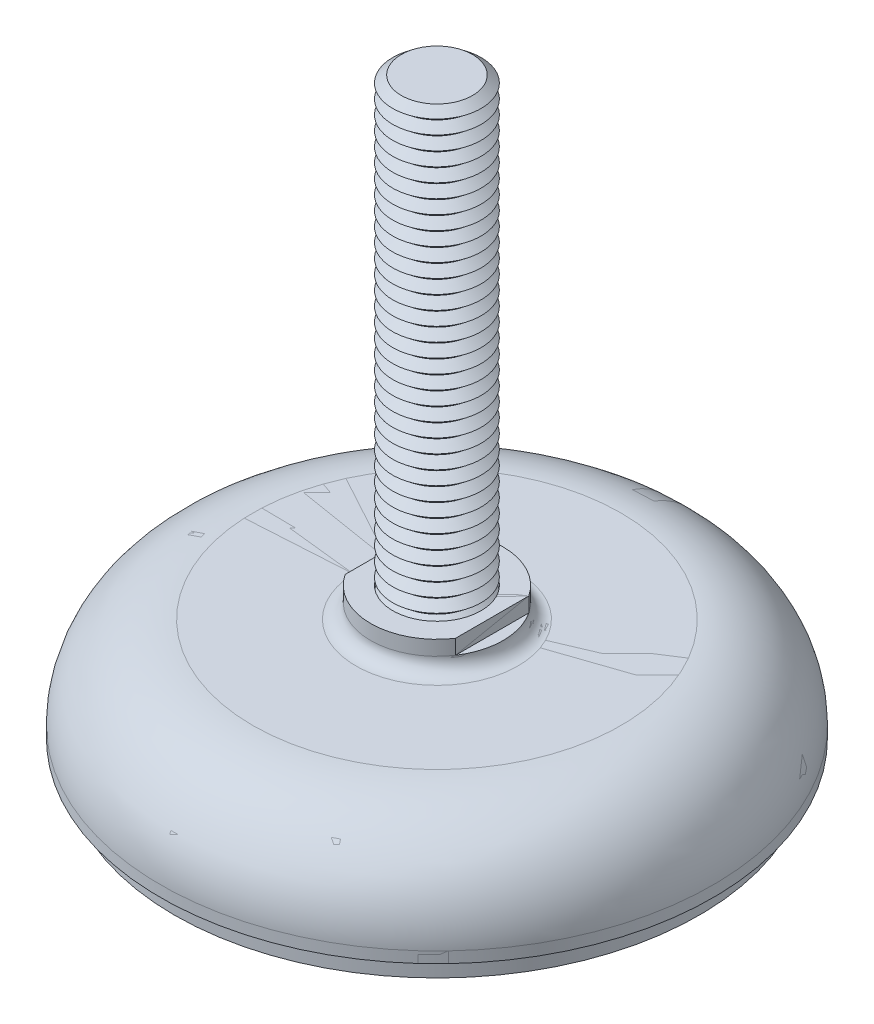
ISO-10303-21;
HEADER;
FILE_DESCRIPTION(('STEP AP214'),'2;1');
FILE_NAME('part.step','',(''),(''),'','','');
FILE_SCHEMA(('AUTOMOTIVE_DESIGN { 1 0 10303 214 1 1 1 1 }'));
ENDSEC;
DATA;
#1=APPLICATION_CONTEXT('core data for automotive mechanical design processes');
#2=APPLICATION_PROTOCOL_DEFINITION('international standard','automotive_design',2000,#1);
#3=PRODUCT_CONTEXT('',#1,'mechanical');
#4=PRODUCT('Part','Part','',(#3));
#5=PRODUCT_RELATED_PRODUCT_CATEGORY('part','',(#4));
#6=PRODUCT_DEFINITION_FORMATION('','',#4);
#7=PRODUCT_DEFINITION_CONTEXT('part definition',#1,'design');
#8=PRODUCT_DEFINITION('design','',#6,#7);
#9=PRODUCT_DEFINITION_SHAPE('','',#8);
#10=(LENGTH_UNIT() NAMED_UNIT(*) SI_UNIT(.MILLI.,.METRE.));
#11=(NAMED_UNIT(*) PLANE_ANGLE_UNIT() SI_UNIT($,.RADIAN.));
#12=(NAMED_UNIT(*) SI_UNIT($,.STERADIAN.) SOLID_ANGLE_UNIT());
#13=UNCERTAINTY_MEASURE_WITH_UNIT(LENGTH_MEASURE(1.E-05),#10,'distance_accuracy_value','');
#14=(GEOMETRIC_REPRESENTATION_CONTEXT(3) GLOBAL_UNCERTAINTY_ASSIGNED_CONTEXT((#13)) GLOBAL_UNIT_ASSIGNED_CONTEXT((#10,
#11,#12)) REPRESENTATION_CONTEXT('',''));
#15=CARTESIAN_POINT('',(0.,0.,0.));
#16=DIRECTION('',(0.,0.,1.));
#17=DIRECTION('',(1.,0.,0.));
#18=AXIS2_PLACEMENT_3D('',#15,#16,#17);
#19=CARTESIAN_POINT('',(0.,49.75,0.));
#20=DIRECTION('',(0.,-1.,0.));
#21=DIRECTION('',(0.998136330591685,0.,-0.0610234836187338));
#22=AXIS2_PLACEMENT_3D('',#19,#20,#21);
#23=CONICAL_SURFACE('',#22,3.2193752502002,0.895664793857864);
#24=CARTESIAN_POINT('',(0.,49.125,0.));
#25=DIRECTION('',(0.,-1.,0.));
#26=DIRECTION('',(0.998136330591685,0.,-0.0610234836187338));
#27=AXIS2_PLACEMENT_3D('',#24,#25,#26);
#28=CIRCLE('',#27,4.);
#29=CARTESIAN_POINT('',(3.99254532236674,49.125,-0.244093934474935));
#30=VERTEX_POINT('',#29);
#31=EDGE_CURVE('P0_E37',#30,#30,#28,.T.);
#32=ORIENTED_EDGE('',*,*,#31,.F.);
#33=EDGE_LOOP('',(#32));
#34=FACE_BOUND('',#33,.T.);
#35=CARTESIAN_POINT('',(0.,49.75,0.));
#36=DIRECTION('',(0.,-1.,0.));
#37=DIRECTION('',(0.998136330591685,0.,-0.0610234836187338));
#38=AXIS2_PLACEMENT_3D('',#35,#36,#37);
#39=CIRCLE('',#38,3.2193752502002);
#40=CARTESIAN_POINT('',(3.21337539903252,49.75,-0.196457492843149));
#41=VERTEX_POINT('',#40);
#42=EDGE_CURVE('P0_E25',#41,#41,#39,.T.);
#43=ORIENTED_EDGE('',*,*,#42,.T.);
#44=EDGE_LOOP('',(#43));
#45=FACE_BOUND('',#44,.T.);
#46=ADVANCED_FACE('P0_F14',(#34,#45),#23,.T.);
#47=CARTESIAN_POINT('',(0.,50.375,0.));
#48=DIRECTION('',(0.,1.,0.));
#49=DIRECTION('',(-0.998136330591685,0.,0.0610234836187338));
#50=AXIS2_PLACEMENT_3D('',#47,#48,#49);
#51=CONICAL_SURFACE('',#50,4.,0.895664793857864);
#52=ORIENTED_EDGE('',*,*,#42,.F.);
#53=EDGE_LOOP('',(#52));
#54=FACE_BOUND('',#53,.T.);
#55=CARTESIAN_POINT('',(0.,50.375,0.));
#56=DIRECTION('',(0.,-1.,0.));
#57=DIRECTION('',(0.998136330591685,0.,-0.0610234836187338));
#58=AXIS2_PLACEMENT_3D('',#55,#56,#57);
#59=CIRCLE('',#58,4.);
#60=CARTESIAN_POINT('',(3.99254532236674,50.375,-0.244093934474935));
#61=VERTEX_POINT('',#60);
#62=EDGE_CURVE('P0_E29',#61,#61,#59,.T.);
#63=ORIENTED_EDGE('',*,*,#62,.T.);
#64=EDGE_LOOP('',(#63));
#65=FACE_BOUND('',#64,.T.);
#66=ADVANCED_FACE('P0_F691',(#54,#65),#51,.T.);
#67=CARTESIAN_POINT('',(0.,51.,0.));
#68=DIRECTION('',(0.,1.,0.));
#69=DIRECTION('',(-0.998136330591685,0.,0.0610234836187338));
#70=AXIS2_PLACEMENT_3D('',#67,#68,#69);
#71=PLANE('',#70);
#72=CARTESIAN_POINT('',(0.,51.,0.));
#73=DIRECTION('',(0.,-1.,0.));
#74=DIRECTION('',(0.998136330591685,0.,-0.0610234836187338));
#75=AXIS2_PLACEMENT_3D('',#72,#73,#74);
#76=CIRCLE('',#75,3.2193752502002);
#77=CARTESIAN_POINT('',(3.21337539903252,51.,-0.196457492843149));
#78=VERTEX_POINT('',#77);
#79=EDGE_CURVE('P0_E21',#78,#78,#76,.T.);
#80=ORIENTED_EDGE('',*,*,#79,.F.);
#81=EDGE_LOOP('',(#80));
#82=FACE_BOUND('',#81,.T.);
#83=ADVANCED_FACE('P0_F697',(#82),#71,.T.);
#84=CARTESIAN_POINT('',(0.,51.,0.));
#85=DIRECTION('',(0.,-1.,0.));
#86=DIRECTION('',(0.998136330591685,0.,-0.0610234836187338));
#87=AXIS2_PLACEMENT_3D('',#84,#85,#86);
#88=CONICAL_SURFACE('',#87,3.2193752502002,0.895664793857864);
#89=ORIENTED_EDGE('',*,*,#62,.F.);
#90=EDGE_LOOP('',(#89));
#91=FACE_BOUND('',#90,.T.);
#92=ORIENTED_EDGE('',*,*,#79,.T.);
#93=EDGE_LOOP('',(#92));
#94=FACE_BOUND('',#93,.T.);
#95=ADVANCED_FACE('P0_F680',(#91,#94),#88,.T.);
#96=CARTESIAN_POINT('',(0.,48.5,0.));
#97=DIRECTION('',(0.,-1.,0.));
#98=DIRECTION('',(0.998136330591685,0.,-0.0610234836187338));
#99=AXIS2_PLACEMENT_3D('',#96,#97,#98);
#100=CONICAL_SURFACE('',#99,3.2193752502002,0.895664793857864);
#101=CARTESIAN_POINT('',(0.,47.875,0.));
#102=DIRECTION('',(0.,-1.,0.));
#103=DIRECTION('',(0.998136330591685,0.,-0.0610234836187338));
#104=AXIS2_PLACEMENT_3D('',#101,#102,#103);
#105=CIRCLE('',#104,4.);
#106=CARTESIAN_POINT('',(3.99254532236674,47.875,-0.244093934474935));
#107=VERTEX_POINT('',#106);
#108=EDGE_CURVE('P0_E43',#107,#107,#105,.T.);
#109=ORIENTED_EDGE('',*,*,#108,.F.);
#110=EDGE_LOOP('',(#109));
#111=FACE_BOUND('',#110,.T.);
#112=CARTESIAN_POINT('',(0.,48.5,0.));
#113=DIRECTION('',(0.,-1.,0.));
#114=DIRECTION('',(0.998136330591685,0.,-0.0610234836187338));
#115=AXIS2_PLACEMENT_3D('',#112,#113,#114);
#116=CIRCLE('',#115,3.2193752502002);
#117=CARTESIAN_POINT('',(3.21337539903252,48.5,-0.196457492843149));
#118=VERTEX_POINT('',#117);
#119=EDGE_CURVE('P0_E34',#118,#118,#116,.T.);
#120=ORIENTED_EDGE('',*,*,#119,.T.);
#121=EDGE_LOOP('',(#120));
#122=FACE_BOUND('',#121,.T.);
#123=ADVANCED_FACE('P0_F677',(#111,#122),#100,.T.);
#124=CARTESIAN_POINT('',(0.,49.125,0.));
#125=DIRECTION('',(0.,1.,0.));
#126=DIRECTION('',(-0.998136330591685,0.,0.0610234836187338));
#127=AXIS2_PLACEMENT_3D('',#124,#125,#126);
#128=CONICAL_SURFACE('',#127,4.,0.895664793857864);
#129=ORIENTED_EDGE('',*,*,#119,.F.);
#130=EDGE_LOOP('',(#129));
#131=FACE_BOUND('',#130,.T.);
#132=ORIENTED_EDGE('',*,*,#31,.T.);
#133=EDGE_LOOP('',(#132));
#134=FACE_BOUND('',#133,.T.);
#135=ADVANCED_FACE('P0_F668',(#131,#134),#128,.T.);
#136=CARTESIAN_POINT('',(0.,47.25,0.));
#137=DIRECTION('',(0.,-1.,0.));
#138=DIRECTION('',(0.998136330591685,0.,-0.0610234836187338));
#139=AXIS2_PLACEMENT_3D('',#136,#137,#138);
#140=CONICAL_SURFACE('',#139,3.2193752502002,0.895664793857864);
#141=CARTESIAN_POINT('',(0.,46.625,0.));
#142=DIRECTION('',(0.,-1.,0.));
#143=DIRECTION('',(0.998136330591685,0.,-0.0610234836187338));
#144=AXIS2_PLACEMENT_3D('',#141,#142,#143);
#145=CIRCLE('',#144,4.);
#146=CARTESIAN_POINT('',(3.99254532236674,46.625,-0.244093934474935));
#147=VERTEX_POINT('',#146);
#148=EDGE_CURVE('P0_E49',#147,#147,#145,.T.);
#149=ORIENTED_EDGE('',*,*,#148,.F.);
#150=EDGE_LOOP('',(#149));
#151=FACE_BOUND('',#150,.T.);
#152=CARTESIAN_POINT('',(0.,47.25,0.));
#153=DIRECTION('',(0.,-1.,0.));
#154=DIRECTION('',(0.998136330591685,0.,-0.0610234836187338));
#155=AXIS2_PLACEMENT_3D('',#152,#153,#154);
#156=CIRCLE('',#155,3.2193752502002);
#157=CARTESIAN_POINT('',(3.21337539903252,47.25,-0.196457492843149));
#158=VERTEX_POINT('',#157);
#159=EDGE_CURVE('P0_E40',#158,#158,#156,.T.);
#160=ORIENTED_EDGE('',*,*,#159,.T.);
#161=EDGE_LOOP('',(#160));
#162=FACE_BOUND('',#161,.T.);
#163=ADVANCED_FACE('P0_F665',(#151,#162),#140,.T.);
#164=CARTESIAN_POINT('',(0.,47.875,0.));
#165=DIRECTION('',(0.,1.,0.));
#166=DIRECTION('',(-0.998136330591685,0.,0.0610234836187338));
#167=AXIS2_PLACEMENT_3D('',#164,#165,#166);
#168=CONICAL_SURFACE('',#167,4.,0.895664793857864);
#169=ORIENTED_EDGE('',*,*,#159,.F.);
#170=EDGE_LOOP('',(#169));
#171=FACE_BOUND('',#170,.T.);
#172=ORIENTED_EDGE('',*,*,#108,.T.);
#173=EDGE_LOOP('',(#172));
#174=FACE_BOUND('',#173,.T.);
#175=ADVANCED_FACE('P0_F656',(#171,#174),#168,.T.);
#176=CARTESIAN_POINT('',(0.,46.,0.));
#177=DIRECTION('',(0.,-1.,0.));
#178=DIRECTION('',(0.998136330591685,0.,-0.0610234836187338));
#179=AXIS2_PLACEMENT_3D('',#176,#177,#178);
#180=CONICAL_SURFACE('',#179,3.2193752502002,0.895664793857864);
#181=CARTESIAN_POINT('',(0.,45.375,0.));
#182=DIRECTION('',(0.,-1.,0.));
#183=DIRECTION('',(0.998136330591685,0.,-0.0610234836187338));
#184=AXIS2_PLACEMENT_3D('',#181,#182,#183);
#185=CIRCLE('',#184,4.);
#186=CARTESIAN_POINT('',(3.99254532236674,45.375,-0.244093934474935));
#187=VERTEX_POINT('',#186);
#188=EDGE_CURVE('P0_E55',#187,#187,#185,.T.);
#189=ORIENTED_EDGE('',*,*,#188,.F.);
#190=EDGE_LOOP('',(#189));
#191=FACE_BOUND('',#190,.T.);
#192=CARTESIAN_POINT('',(0.,46.,0.));
#193=DIRECTION('',(0.,-1.,0.));
#194=DIRECTION('',(0.998136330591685,0.,-0.0610234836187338));
#195=AXIS2_PLACEMENT_3D('',#192,#193,#194);
#196=CIRCLE('',#195,3.2193752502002);
#197=CARTESIAN_POINT('',(3.21337539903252,46.,-0.196457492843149));
#198=VERTEX_POINT('',#197);
#199=EDGE_CURVE('P0_E46',#198,#198,#196,.T.);
#200=ORIENTED_EDGE('',*,*,#199,.T.);
#201=EDGE_LOOP('',(#200));
#202=FACE_BOUND('',#201,.T.);
#203=ADVANCED_FACE('P0_F653',(#191,#202),#180,.T.);
#204=CARTESIAN_POINT('',(0.,46.625,0.));
#205=DIRECTION('',(0.,1.,0.));
#206=DIRECTION('',(-0.998136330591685,0.,0.0610234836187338));
#207=AXIS2_PLACEMENT_3D('',#204,#205,#206);
#208=CONICAL_SURFACE('',#207,4.,0.895664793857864);
#209=ORIENTED_EDGE('',*,*,#199,.F.);
#210=EDGE_LOOP('',(#209));
#211=FACE_BOUND('',#210,.T.);
#212=ORIENTED_EDGE('',*,*,#148,.T.);
#213=EDGE_LOOP('',(#212));
#214=FACE_BOUND('',#213,.T.);
#215=ADVANCED_FACE('P0_F644',(#211,#214),#208,.T.);
#216=CARTESIAN_POINT('',(0.,44.75,0.));
#217=DIRECTION('',(0.,-1.,0.));
#218=DIRECTION('',(0.998136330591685,0.,-0.0610234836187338));
#219=AXIS2_PLACEMENT_3D('',#216,#217,#218);
#220=CONICAL_SURFACE('',#219,3.2193752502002,0.895664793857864);
#221=CARTESIAN_POINT('',(0.,44.125,0.));
#222=DIRECTION('',(0.,-1.,0.));
#223=DIRECTION('',(0.998136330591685,0.,-0.0610234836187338));
#224=AXIS2_PLACEMENT_3D('',#221,#222,#223);
#225=CIRCLE('',#224,4.);
#226=CARTESIAN_POINT('',(3.99254532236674,44.125,-0.244093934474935));
#227=VERTEX_POINT('',#226);
#228=EDGE_CURVE('P0_E61',#227,#227,#225,.T.);
#229=ORIENTED_EDGE('',*,*,#228,.F.);
#230=EDGE_LOOP('',(#229));
#231=FACE_BOUND('',#230,.T.);
#232=CARTESIAN_POINT('',(0.,44.75,0.));
#233=DIRECTION('',(0.,-1.,0.));
#234=DIRECTION('',(0.998136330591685,0.,-0.0610234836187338));
#235=AXIS2_PLACEMENT_3D('',#232,#233,#234);
#236=CIRCLE('',#235,3.2193752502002);
#237=CARTESIAN_POINT('',(3.21337539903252,44.75,-0.196457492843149));
#238=VERTEX_POINT('',#237);
#239=EDGE_CURVE('P0_E52',#238,#238,#236,.T.);
#240=ORIENTED_EDGE('',*,*,#239,.T.);
#241=EDGE_LOOP('',(#240));
#242=FACE_BOUND('',#241,.T.);
#243=ADVANCED_FACE('P0_F641',(#231,#242),#220,.T.);
#244=CARTESIAN_POINT('',(0.,45.375,0.));
#245=DIRECTION('',(0.,1.,0.));
#246=DIRECTION('',(-0.998136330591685,0.,0.0610234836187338));
#247=AXIS2_PLACEMENT_3D('',#244,#245,#246);
#248=CONICAL_SURFACE('',#247,4.,0.895664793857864);
#249=ORIENTED_EDGE('',*,*,#239,.F.);
#250=EDGE_LOOP('',(#249));
#251=FACE_BOUND('',#250,.T.);
#252=ORIENTED_EDGE('',*,*,#188,.T.);
#253=EDGE_LOOP('',(#252));
#254=FACE_BOUND('',#253,.T.);
#255=ADVANCED_FACE('P0_F632',(#251,#254),#248,.T.);
#256=CARTESIAN_POINT('',(0.,43.5,0.));
#257=DIRECTION('',(0.,-1.,0.));
#258=DIRECTION('',(0.998136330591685,0.,-0.0610234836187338));
#259=AXIS2_PLACEMENT_3D('',#256,#257,#258);
#260=CONICAL_SURFACE('',#259,3.2193752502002,0.895664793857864);
#261=CARTESIAN_POINT('',(0.,42.875,0.));
#262=DIRECTION('',(0.,-1.,0.));
#263=DIRECTION('',(0.998136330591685,0.,-0.0610234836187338));
#264=AXIS2_PLACEMENT_3D('',#261,#262,#263);
#265=CIRCLE('',#264,4.);
#266=CARTESIAN_POINT('',(3.99254532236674,42.875,-0.244093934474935));
#267=VERTEX_POINT('',#266);
#268=EDGE_CURVE('P0_E67',#267,#267,#265,.T.);
#269=ORIENTED_EDGE('',*,*,#268,.F.);
#270=EDGE_LOOP('',(#269));
#271=FACE_BOUND('',#270,.T.);
#272=CARTESIAN_POINT('',(0.,43.5,0.));
#273=DIRECTION('',(0.,-1.,0.));
#274=DIRECTION('',(0.998136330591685,0.,-0.0610234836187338));
#275=AXIS2_PLACEMENT_3D('',#272,#273,#274);
#276=CIRCLE('',#275,3.2193752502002);
#277=CARTESIAN_POINT('',(3.21337539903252,43.5,-0.196457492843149));
#278=VERTEX_POINT('',#277);
#279=EDGE_CURVE('P0_E58',#278,#278,#276,.T.);
#280=ORIENTED_EDGE('',*,*,#279,.T.);
#281=EDGE_LOOP('',(#280));
#282=FACE_BOUND('',#281,.T.);
#283=ADVANCED_FACE('P0_F629',(#271,#282),#260,.T.);
#284=CARTESIAN_POINT('',(0.,44.125,0.));
#285=DIRECTION('',(0.,1.,0.));
#286=DIRECTION('',(-0.998136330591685,0.,0.0610234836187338));
#287=AXIS2_PLACEMENT_3D('',#284,#285,#286);
#288=CONICAL_SURFACE('',#287,4.,0.895664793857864);
#289=ORIENTED_EDGE('',*,*,#279,.F.);
#290=EDGE_LOOP('',(#289));
#291=FACE_BOUND('',#290,.T.);
#292=ORIENTED_EDGE('',*,*,#228,.T.);
#293=EDGE_LOOP('',(#292));
#294=FACE_BOUND('',#293,.T.);
#295=ADVANCED_FACE('P0_F620',(#291,#294),#288,.T.);
#296=CARTESIAN_POINT('',(0.,42.25,0.));
#297=DIRECTION('',(0.,-1.,0.));
#298=DIRECTION('',(0.998136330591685,0.,-0.0610234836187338));
#299=AXIS2_PLACEMENT_3D('',#296,#297,#298);
#300=CONICAL_SURFACE('',#299,3.2193752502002,0.895664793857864);
#301=CARTESIAN_POINT('',(0.,41.625,0.));
#302=DIRECTION('',(0.,-1.,0.));
#303=DIRECTION('',(0.998136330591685,0.,-0.0610234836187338));
#304=AXIS2_PLACEMENT_3D('',#301,#302,#303);
#305=CIRCLE('',#304,4.);
#306=CARTESIAN_POINT('',(3.99254532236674,41.625,-0.244093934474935));
#307=VERTEX_POINT('',#306);
#308=EDGE_CURVE('P0_E73',#307,#307,#305,.T.);
#309=ORIENTED_EDGE('',*,*,#308,.F.);
#310=EDGE_LOOP('',(#309));
#311=FACE_BOUND('',#310,.T.);
#312=CARTESIAN_POINT('',(0.,42.25,0.));
#313=DIRECTION('',(0.,-1.,0.));
#314=DIRECTION('',(0.998136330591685,0.,-0.0610234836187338));
#315=AXIS2_PLACEMENT_3D('',#312,#313,#314);
#316=CIRCLE('',#315,3.2193752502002);
#317=CARTESIAN_POINT('',(3.21337539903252,42.25,-0.196457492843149));
#318=VERTEX_POINT('',#317);
#319=EDGE_CURVE('P0_E64',#318,#318,#316,.T.);
#320=ORIENTED_EDGE('',*,*,#319,.T.);
#321=EDGE_LOOP('',(#320));
#322=FACE_BOUND('',#321,.T.);
#323=ADVANCED_FACE('P0_F617',(#311,#322),#300,.T.);
#324=CARTESIAN_POINT('',(0.,42.875,0.));
#325=DIRECTION('',(0.,1.,0.));
#326=DIRECTION('',(-0.998136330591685,0.,0.0610234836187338));
#327=AXIS2_PLACEMENT_3D('',#324,#325,#326);
#328=CONICAL_SURFACE('',#327,4.,0.895664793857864);
#329=ORIENTED_EDGE('',*,*,#319,.F.);
#330=EDGE_LOOP('',(#329));
#331=FACE_BOUND('',#330,.T.);
#332=ORIENTED_EDGE('',*,*,#268,.T.);
#333=EDGE_LOOP('',(#332));
#334=FACE_BOUND('',#333,.T.);
#335=ADVANCED_FACE('P0_F608',(#331,#334),#328,.T.);
#336=CARTESIAN_POINT('',(0.,41.,0.));
#337=DIRECTION('',(0.,-1.,0.));
#338=DIRECTION('',(0.998136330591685,0.,-0.0610234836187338));
#339=AXIS2_PLACEMENT_3D('',#336,#337,#338);
#340=CONICAL_SURFACE('',#339,3.2193752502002,0.895664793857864);
#341=CARTESIAN_POINT('',(0.,40.375,0.));
#342=DIRECTION('',(0.,-1.,0.));
#343=DIRECTION('',(0.998136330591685,0.,-0.0610234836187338));
#344=AXIS2_PLACEMENT_3D('',#341,#342,#343);
#345=CIRCLE('',#344,4.);
#346=CARTESIAN_POINT('',(3.99254532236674,40.375,-0.244093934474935));
#347=VERTEX_POINT('',#346);
#348=EDGE_CURVE('P0_E79',#347,#347,#345,.T.);
#349=ORIENTED_EDGE('',*,*,#348,.F.);
#350=EDGE_LOOP('',(#349));
#351=FACE_BOUND('',#350,.T.);
#352=CARTESIAN_POINT('',(0.,41.,0.));
#353=DIRECTION('',(0.,-1.,0.));
#354=DIRECTION('',(0.998136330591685,0.,-0.0610234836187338));
#355=AXIS2_PLACEMENT_3D('',#352,#353,#354);
#356=CIRCLE('',#355,3.2193752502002);
#357=CARTESIAN_POINT('',(3.21337539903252,41.,-0.196457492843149));
#358=VERTEX_POINT('',#357);
#359=EDGE_CURVE('P0_E70',#358,#358,#356,.T.);
#360=ORIENTED_EDGE('',*,*,#359,.T.);
#361=EDGE_LOOP('',(#360));
#362=FACE_BOUND('',#361,.T.);
#363=ADVANCED_FACE('P0_F605',(#351,#362),#340,.T.);
#364=CARTESIAN_POINT('',(0.,41.625,0.));
#365=DIRECTION('',(0.,1.,0.));
#366=DIRECTION('',(-0.998136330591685,0.,0.0610234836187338));
#367=AXIS2_PLACEMENT_3D('',#364,#365,#366);
#368=CONICAL_SURFACE('',#367,4.,0.895664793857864);
#369=ORIENTED_EDGE('',*,*,#359,.F.);
#370=EDGE_LOOP('',(#369));
#371=FACE_BOUND('',#370,.T.);
#372=ORIENTED_EDGE('',*,*,#308,.T.);
#373=EDGE_LOOP('',(#372));
#374=FACE_BOUND('',#373,.T.);
#375=ADVANCED_FACE('P0_F596',(#371,#374),#368,.T.);
#376=CARTESIAN_POINT('',(0.,39.75,0.));
#377=DIRECTION('',(0.,-1.,0.));
#378=DIRECTION('',(0.998136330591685,0.,-0.0610234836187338));
#379=AXIS2_PLACEMENT_3D('',#376,#377,#378);
#380=CONICAL_SURFACE('',#379,3.2193752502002,0.895664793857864);
#381=CARTESIAN_POINT('',(0.,39.125,0.));
#382=DIRECTION('',(0.,-1.,0.));
#383=DIRECTION('',(0.998136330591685,0.,-0.0610234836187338));
#384=AXIS2_PLACEMENT_3D('',#381,#382,#383);
#385=CIRCLE('',#384,4.);
#386=CARTESIAN_POINT('',(3.99254532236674,39.125,-0.244093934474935));
#387=VERTEX_POINT('',#386);
#388=EDGE_CURVE('P0_E85',#387,#387,#385,.T.);
#389=ORIENTED_EDGE('',*,*,#388,.F.);
#390=EDGE_LOOP('',(#389));
#391=FACE_BOUND('',#390,.T.);
#392=CARTESIAN_POINT('',(0.,39.75,0.));
#393=DIRECTION('',(0.,-1.,0.));
#394=DIRECTION('',(0.998136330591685,0.,-0.0610234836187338));
#395=AXIS2_PLACEMENT_3D('',#392,#393,#394);
#396=CIRCLE('',#395,3.2193752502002);
#397=CARTESIAN_POINT('',(3.21337539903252,39.75,-0.196457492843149));
#398=VERTEX_POINT('',#397);
#399=EDGE_CURVE('P0_E76',#398,#398,#396,.T.);
#400=ORIENTED_EDGE('',*,*,#399,.T.);
#401=EDGE_LOOP('',(#400));
#402=FACE_BOUND('',#401,.T.);
#403=ADVANCED_FACE('P0_F593',(#391,#402),#380,.T.);
#404=CARTESIAN_POINT('',(0.,40.375,0.));
#405=DIRECTION('',(0.,1.,0.));
#406=DIRECTION('',(-0.998136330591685,0.,0.0610234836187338));
#407=AXIS2_PLACEMENT_3D('',#404,#405,#406);
#408=CONICAL_SURFACE('',#407,4.,0.895664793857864);
#409=ORIENTED_EDGE('',*,*,#399,.F.);
#410=EDGE_LOOP('',(#409));
#411=FACE_BOUND('',#410,.T.);
#412=ORIENTED_EDGE('',*,*,#348,.T.);
#413=EDGE_LOOP('',(#412));
#414=FACE_BOUND('',#413,.T.);
#415=ADVANCED_FACE('P0_F584',(#411,#414),#408,.T.);
#416=CARTESIAN_POINT('',(0.,38.5,0.));
#417=DIRECTION('',(0.,-1.,0.));
#418=DIRECTION('',(0.998136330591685,0.,-0.0610234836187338));
#419=AXIS2_PLACEMENT_3D('',#416,#417,#418);
#420=CONICAL_SURFACE('',#419,3.2193752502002,0.895664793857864);
#421=CARTESIAN_POINT('',(0.,37.875,0.));
#422=DIRECTION('',(0.,-1.,0.));
#423=DIRECTION('',(0.998136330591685,0.,-0.0610234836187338));
#424=AXIS2_PLACEMENT_3D('',#421,#422,#423);
#425=CIRCLE('',#424,4.);
#426=CARTESIAN_POINT('',(3.99254532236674,37.875,-0.244093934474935));
#427=VERTEX_POINT('',#426);
#428=EDGE_CURVE('P0_E91',#427,#427,#425,.T.);
#429=ORIENTED_EDGE('',*,*,#428,.F.);
#430=EDGE_LOOP('',(#429));
#431=FACE_BOUND('',#430,.T.);
#432=CARTESIAN_POINT('',(0.,38.5,0.));
#433=DIRECTION('',(0.,-1.,0.));
#434=DIRECTION('',(0.998136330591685,0.,-0.0610234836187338));
#435=AXIS2_PLACEMENT_3D('',#432,#433,#434);
#436=CIRCLE('',#435,3.2193752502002);
#437=CARTESIAN_POINT('',(3.21337539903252,38.5,-0.196457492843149));
#438=VERTEX_POINT('',#437);
#439=EDGE_CURVE('P0_E82',#438,#438,#436,.T.);
#440=ORIENTED_EDGE('',*,*,#439,.T.);
#441=EDGE_LOOP('',(#440));
#442=FACE_BOUND('',#441,.T.);
#443=ADVANCED_FACE('P0_F581',(#431,#442),#420,.T.);
#444=CARTESIAN_POINT('',(0.,39.125,0.));
#445=DIRECTION('',(0.,1.,0.));
#446=DIRECTION('',(-0.998136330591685,0.,0.0610234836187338));
#447=AXIS2_PLACEMENT_3D('',#444,#445,#446);
#448=CONICAL_SURFACE('',#447,4.,0.895664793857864);
#449=ORIENTED_EDGE('',*,*,#439,.F.);
#450=EDGE_LOOP('',(#449));
#451=FACE_BOUND('',#450,.T.);
#452=ORIENTED_EDGE('',*,*,#388,.T.);
#453=EDGE_LOOP('',(#452));
#454=FACE_BOUND('',#453,.T.);
#455=ADVANCED_FACE('P0_F572',(#451,#454),#448,.T.);
#456=CARTESIAN_POINT('',(0.,37.25,0.));
#457=DIRECTION('',(0.,-1.,0.));
#458=DIRECTION('',(0.998136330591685,0.,-0.0610234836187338));
#459=AXIS2_PLACEMENT_3D('',#456,#457,#458);
#460=CONICAL_SURFACE('',#459,3.2193752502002,0.895664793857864);
#461=CARTESIAN_POINT('',(0.,36.625,0.));
#462=DIRECTION('',(0.,-1.,0.));
#463=DIRECTION('',(0.998136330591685,0.,-0.0610234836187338));
#464=AXIS2_PLACEMENT_3D('',#461,#462,#463);
#465=CIRCLE('',#464,4.);
#466=CARTESIAN_POINT('',(3.99254532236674,36.625,-0.244093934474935));
#467=VERTEX_POINT('',#466);
#468=EDGE_CURVE('P0_E97',#467,#467,#465,.T.);
#469=ORIENTED_EDGE('',*,*,#468,.F.);
#470=EDGE_LOOP('',(#469));
#471=FACE_BOUND('',#470,.T.);
#472=CARTESIAN_POINT('',(0.,37.25,0.));
#473=DIRECTION('',(0.,-1.,0.));
#474=DIRECTION('',(0.998136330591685,0.,-0.0610234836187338));
#475=AXIS2_PLACEMENT_3D('',#472,#473,#474);
#476=CIRCLE('',#475,3.2193752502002);
#477=CARTESIAN_POINT('',(3.21337539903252,37.25,-0.196457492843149));
#478=VERTEX_POINT('',#477);
#479=EDGE_CURVE('P0_E88',#478,#478,#476,.T.);
#480=ORIENTED_EDGE('',*,*,#479,.T.);
#481=EDGE_LOOP('',(#480));
#482=FACE_BOUND('',#481,.T.);
#483=ADVANCED_FACE('P0_F569',(#471,#482),#460,.T.);
#484=CARTESIAN_POINT('',(0.,37.875,0.));
#485=DIRECTION('',(0.,1.,0.));
#486=DIRECTION('',(-0.998136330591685,0.,0.0610234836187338));
#487=AXIS2_PLACEMENT_3D('',#484,#485,#486);
#488=CONICAL_SURFACE('',#487,4.,0.895664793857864);
#489=ORIENTED_EDGE('',*,*,#479,.F.);
#490=EDGE_LOOP('',(#489));
#491=FACE_BOUND('',#490,.T.);
#492=ORIENTED_EDGE('',*,*,#428,.T.);
#493=EDGE_LOOP('',(#492));
#494=FACE_BOUND('',#493,.T.);
#495=ADVANCED_FACE('P0_F560',(#491,#494),#488,.T.);
#496=CARTESIAN_POINT('',(0.,36.,0.));
#497=DIRECTION('',(0.,-1.,0.));
#498=DIRECTION('',(0.998136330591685,0.,-0.0610234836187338));
#499=AXIS2_PLACEMENT_3D('',#496,#497,#498);
#500=CONICAL_SURFACE('',#499,3.2193752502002,0.895664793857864);
#501=CARTESIAN_POINT('',(0.,35.375,0.));
#502=DIRECTION('',(0.,-1.,0.));
#503=DIRECTION('',(0.998136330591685,0.,-0.0610234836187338));
#504=AXIS2_PLACEMENT_3D('',#501,#502,#503);
#505=CIRCLE('',#504,4.);
#506=CARTESIAN_POINT('',(3.99254532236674,35.375,-0.244093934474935));
#507=VERTEX_POINT('',#506);
#508=EDGE_CURVE('P0_E103',#507,#507,#505,.T.);
#509=ORIENTED_EDGE('',*,*,#508,.F.);
#510=EDGE_LOOP('',(#509));
#511=FACE_BOUND('',#510,.T.);
#512=CARTESIAN_POINT('',(0.,36.,0.));
#513=DIRECTION('',(0.,-1.,0.));
#514=DIRECTION('',(0.998136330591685,0.,-0.0610234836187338));
#515=AXIS2_PLACEMENT_3D('',#512,#513,#514);
#516=CIRCLE('',#515,3.2193752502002);
#517=CARTESIAN_POINT('',(3.21337539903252,36.,-0.196457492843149));
#518=VERTEX_POINT('',#517);
#519=EDGE_CURVE('P0_E94',#518,#518,#516,.T.);
#520=ORIENTED_EDGE('',*,*,#519,.T.);
#521=EDGE_LOOP('',(#520));
#522=FACE_BOUND('',#521,.T.);
#523=ADVANCED_FACE('P0_F557',(#511,#522),#500,.T.);
#524=CARTESIAN_POINT('',(0.,36.625,0.));
#525=DIRECTION('',(0.,1.,0.));
#526=DIRECTION('',(-0.998136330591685,0.,0.0610234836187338));
#527=AXIS2_PLACEMENT_3D('',#524,#525,#526);
#528=CONICAL_SURFACE('',#527,4.,0.895664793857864);
#529=ORIENTED_EDGE('',*,*,#519,.F.);
#530=EDGE_LOOP('',(#529));
#531=FACE_BOUND('',#530,.T.);
#532=ORIENTED_EDGE('',*,*,#468,.T.);
#533=EDGE_LOOP('',(#532));
#534=FACE_BOUND('',#533,.T.);
#535=ADVANCED_FACE('P0_F548',(#531,#534),#528,.T.);
#536=CARTESIAN_POINT('',(0.,34.75,0.));
#537=DIRECTION('',(0.,-1.,0.));
#538=DIRECTION('',(0.998136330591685,0.,-0.0610234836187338));
#539=AXIS2_PLACEMENT_3D('',#536,#537,#538);
#540=CONICAL_SURFACE('',#539,3.2193752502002,0.895664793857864);
#541=CARTESIAN_POINT('',(0.,34.125,0.));
#542=DIRECTION('',(0.,-1.,0.));
#543=DIRECTION('',(0.998136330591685,0.,-0.0610234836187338));
#544=AXIS2_PLACEMENT_3D('',#541,#542,#543);
#545=CIRCLE('',#544,4.);
#546=CARTESIAN_POINT('',(3.99254532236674,34.125,-0.244093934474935));
#547=VERTEX_POINT('',#546);
#548=EDGE_CURVE('P0_E109',#547,#547,#545,.T.);
#549=ORIENTED_EDGE('',*,*,#548,.F.);
#550=EDGE_LOOP('',(#549));
#551=FACE_BOUND('',#550,.T.);
#552=CARTESIAN_POINT('',(0.,34.75,0.));
#553=DIRECTION('',(0.,-1.,0.));
#554=DIRECTION('',(0.998136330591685,0.,-0.0610234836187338));
#555=AXIS2_PLACEMENT_3D('',#552,#553,#554);
#556=CIRCLE('',#555,3.2193752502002);
#557=CARTESIAN_POINT('',(3.21337539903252,34.75,-0.196457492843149));
#558=VERTEX_POINT('',#557);
#559=EDGE_CURVE('P0_E100',#558,#558,#556,.T.);
#560=ORIENTED_EDGE('',*,*,#559,.T.);
#561=EDGE_LOOP('',(#560));
#562=FACE_BOUND('',#561,.T.);
#563=ADVANCED_FACE('P0_F545',(#551,#562),#540,.T.);
#564=CARTESIAN_POINT('',(0.,35.375,0.));
#565=DIRECTION('',(0.,1.,0.));
#566=DIRECTION('',(-0.998136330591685,0.,0.0610234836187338));
#567=AXIS2_PLACEMENT_3D('',#564,#565,#566);
#568=CONICAL_SURFACE('',#567,4.,0.895664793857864);
#569=ORIENTED_EDGE('',*,*,#559,.F.);
#570=EDGE_LOOP('',(#569));
#571=FACE_BOUND('',#570,.T.);
#572=ORIENTED_EDGE('',*,*,#508,.T.);
#573=EDGE_LOOP('',(#572));
#574=FACE_BOUND('',#573,.T.);
#575=ADVANCED_FACE('P0_F536',(#571,#574),#568,.T.);
#576=CARTESIAN_POINT('',(0.,33.5,0.));
#577=DIRECTION('',(0.,-1.,0.));
#578=DIRECTION('',(0.998136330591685,0.,-0.0610234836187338));
#579=AXIS2_PLACEMENT_3D('',#576,#577,#578);
#580=CONICAL_SURFACE('',#579,3.2193752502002,0.895664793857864);
#581=CARTESIAN_POINT('',(0.,32.875,0.));
#582=DIRECTION('',(0.,-1.,0.));
#583=DIRECTION('',(0.998136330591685,0.,-0.0610234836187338));
#584=AXIS2_PLACEMENT_3D('',#581,#582,#583);
#585=CIRCLE('',#584,4.);
#586=CARTESIAN_POINT('',(3.99254532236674,32.875,-0.244093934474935));
#587=VERTEX_POINT('',#586);
#588=EDGE_CURVE('P0_E115',#587,#587,#585,.T.);
#589=ORIENTED_EDGE('',*,*,#588,.F.);
#590=EDGE_LOOP('',(#589));
#591=FACE_BOUND('',#590,.T.);
#592=CARTESIAN_POINT('',(0.,33.5,0.));
#593=DIRECTION('',(0.,-1.,0.));
#594=DIRECTION('',(0.998136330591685,0.,-0.0610234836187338));
#595=AXIS2_PLACEMENT_3D('',#592,#593,#594);
#596=CIRCLE('',#595,3.2193752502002);
#597=CARTESIAN_POINT('',(3.21337539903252,33.5,-0.196457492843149));
#598=VERTEX_POINT('',#597);
#599=EDGE_CURVE('P0_E106',#598,#598,#596,.T.);
#600=ORIENTED_EDGE('',*,*,#599,.T.);
#601=EDGE_LOOP('',(#600));
#602=FACE_BOUND('',#601,.T.);
#603=ADVANCED_FACE('P0_F533',(#591,#602),#580,.T.);
#604=CARTESIAN_POINT('',(0.,34.125,0.));
#605=DIRECTION('',(0.,1.,0.));
#606=DIRECTION('',(-0.998136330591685,0.,0.0610234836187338));
#607=AXIS2_PLACEMENT_3D('',#604,#605,#606);
#608=CONICAL_SURFACE('',#607,4.,0.895664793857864);
#609=ORIENTED_EDGE('',*,*,#599,.F.);
#610=EDGE_LOOP('',(#609));
#611=FACE_BOUND('',#610,.T.);
#612=ORIENTED_EDGE('',*,*,#548,.T.);
#613=EDGE_LOOP('',(#612));
#614=FACE_BOUND('',#613,.T.);
#615=ADVANCED_FACE('P0_F524',(#611,#614),#608,.T.);
#616=CARTESIAN_POINT('',(0.,32.25,0.));
#617=DIRECTION('',(0.,-1.,0.));
#618=DIRECTION('',(0.998136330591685,0.,-0.0610234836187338));
#619=AXIS2_PLACEMENT_3D('',#616,#617,#618);
#620=CONICAL_SURFACE('',#619,3.2193752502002,0.895664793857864);
#621=CARTESIAN_POINT('',(0.,31.625,0.));
#622=DIRECTION('',(0.,-1.,0.));
#623=DIRECTION('',(0.998136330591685,0.,-0.0610234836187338));
#624=AXIS2_PLACEMENT_3D('',#621,#622,#623);
#625=CIRCLE('',#624,4.);
#626=CARTESIAN_POINT('',(3.99254532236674,31.625,-0.244093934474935));
#627=VERTEX_POINT('',#626);
#628=EDGE_CURVE('P0_E121',#627,#627,#625,.T.);
#629=ORIENTED_EDGE('',*,*,#628,.F.);
#630=EDGE_LOOP('',(#629));
#631=FACE_BOUND('',#630,.T.);
#632=CARTESIAN_POINT('',(0.,32.25,0.));
#633=DIRECTION('',(0.,-1.,0.));
#634=DIRECTION('',(0.998136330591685,0.,-0.0610234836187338));
#635=AXIS2_PLACEMENT_3D('',#632,#633,#634);
#636=CIRCLE('',#635,3.2193752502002);
#637=CARTESIAN_POINT('',(3.21337539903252,32.25,-0.196457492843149));
#638=VERTEX_POINT('',#637);
#639=EDGE_CURVE('P0_E112',#638,#638,#636,.T.);
#640=ORIENTED_EDGE('',*,*,#639,.T.);
#641=EDGE_LOOP('',(#640));
#642=FACE_BOUND('',#641,.T.);
#643=ADVANCED_FACE('P0_F521',(#631,#642),#620,.T.);
#644=CARTESIAN_POINT('',(0.,32.875,0.));
#645=DIRECTION('',(0.,1.,0.));
#646=DIRECTION('',(-0.998136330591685,0.,0.0610234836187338));
#647=AXIS2_PLACEMENT_3D('',#644,#645,#646);
#648=CONICAL_SURFACE('',#647,4.,0.895664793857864);
#649=ORIENTED_EDGE('',*,*,#639,.F.);
#650=EDGE_LOOP('',(#649));
#651=FACE_BOUND('',#650,.T.);
#652=ORIENTED_EDGE('',*,*,#588,.T.);
#653=EDGE_LOOP('',(#652));
#654=FACE_BOUND('',#653,.T.);
#655=ADVANCED_FACE('P0_F512',(#651,#654),#648,.T.);
#656=CARTESIAN_POINT('',(0.,31.,0.));
#657=DIRECTION('',(0.,-1.,0.));
#658=DIRECTION('',(0.998136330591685,0.,-0.0610234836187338));
#659=AXIS2_PLACEMENT_3D('',#656,#657,#658);
#660=CONICAL_SURFACE('',#659,3.2193752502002,0.895664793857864);
#661=CARTESIAN_POINT('',(0.,30.375,0.));
#662=DIRECTION('',(0.,-1.,0.));
#663=DIRECTION('',(0.998136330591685,0.,-0.0610234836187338));
#664=AXIS2_PLACEMENT_3D('',#661,#662,#663);
#665=CIRCLE('',#664,4.);
#666=CARTESIAN_POINT('',(3.99254532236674,30.375,-0.244093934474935));
#667=VERTEX_POINT('',#666);
#668=EDGE_CURVE('P0_E127',#667,#667,#665,.T.);
#669=ORIENTED_EDGE('',*,*,#668,.F.);
#670=EDGE_LOOP('',(#669));
#671=FACE_BOUND('',#670,.T.);
#672=CARTESIAN_POINT('',(0.,31.,0.));
#673=DIRECTION('',(0.,-1.,0.));
#674=DIRECTION('',(0.998136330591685,0.,-0.0610234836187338));
#675=AXIS2_PLACEMENT_3D('',#672,#673,#674);
#676=CIRCLE('',#675,3.2193752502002);
#677=CARTESIAN_POINT('',(3.21337539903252,31.,-0.196457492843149));
#678=VERTEX_POINT('',#677);
#679=EDGE_CURVE('P0_E118',#678,#678,#676,.T.);
#680=ORIENTED_EDGE('',*,*,#679,.T.);
#681=EDGE_LOOP('',(#680));
#682=FACE_BOUND('',#681,.T.);
#683=ADVANCED_FACE('P0_F509',(#671,#682),#660,.T.);
#684=CARTESIAN_POINT('',(0.,31.625,0.));
#685=DIRECTION('',(0.,1.,0.));
#686=DIRECTION('',(-0.998136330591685,0.,0.0610234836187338));
#687=AXIS2_PLACEMENT_3D('',#684,#685,#686);
#688=CONICAL_SURFACE('',#687,4.,0.895664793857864);
#689=ORIENTED_EDGE('',*,*,#679,.F.);
#690=EDGE_LOOP('',(#689));
#691=FACE_BOUND('',#690,.T.);
#692=ORIENTED_EDGE('',*,*,#628,.T.);
#693=EDGE_LOOP('',(#692));
#694=FACE_BOUND('',#693,.T.);
#695=ADVANCED_FACE('P0_F500',(#691,#694),#688,.T.);
#696=CARTESIAN_POINT('',(0.,29.75,0.));
#697=DIRECTION('',(0.,-1.,0.));
#698=DIRECTION('',(0.998136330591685,0.,-0.0610234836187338));
#699=AXIS2_PLACEMENT_3D('',#696,#697,#698);
#700=CONICAL_SURFACE('',#699,3.2193752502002,0.895664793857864);
#701=CARTESIAN_POINT('',(0.,29.125,0.));
#702=DIRECTION('',(0.,-1.,0.));
#703=DIRECTION('',(0.998136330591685,0.,-0.0610234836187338));
#704=AXIS2_PLACEMENT_3D('',#701,#702,#703);
#705=CIRCLE('',#704,4.);
#706=CARTESIAN_POINT('',(3.99254532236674,29.125,-0.244093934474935));
#707=VERTEX_POINT('',#706);
#708=EDGE_CURVE('P0_E133',#707,#707,#705,.T.);
#709=ORIENTED_EDGE('',*,*,#708,.F.);
#710=EDGE_LOOP('',(#709));
#711=FACE_BOUND('',#710,.T.);
#712=CARTESIAN_POINT('',(0.,29.75,0.));
#713=DIRECTION('',(0.,-1.,0.));
#714=DIRECTION('',(0.998136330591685,0.,-0.0610234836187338));
#715=AXIS2_PLACEMENT_3D('',#712,#713,#714);
#716=CIRCLE('',#715,3.2193752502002);
#717=CARTESIAN_POINT('',(3.21337539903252,29.75,-0.196457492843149));
#718=VERTEX_POINT('',#717);
#719=EDGE_CURVE('P0_E124',#718,#718,#716,.T.);
#720=ORIENTED_EDGE('',*,*,#719,.T.);
#721=EDGE_LOOP('',(#720));
#722=FACE_BOUND('',#721,.T.);
#723=ADVANCED_FACE('P0_F497',(#711,#722),#700,.T.);
#724=CARTESIAN_POINT('',(0.,30.375,0.));
#725=DIRECTION('',(0.,1.,0.));
#726=DIRECTION('',(-0.998136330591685,0.,0.0610234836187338));
#727=AXIS2_PLACEMENT_3D('',#724,#725,#726);
#728=CONICAL_SURFACE('',#727,4.,0.895664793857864);
#729=ORIENTED_EDGE('',*,*,#719,.F.);
#730=EDGE_LOOP('',(#729));
#731=FACE_BOUND('',#730,.T.);
#732=ORIENTED_EDGE('',*,*,#668,.T.);
#733=EDGE_LOOP('',(#732));
#734=FACE_BOUND('',#733,.T.);
#735=ADVANCED_FACE('P0_F488',(#731,#734),#728,.T.);
#736=CARTESIAN_POINT('',(0.,28.5,0.));
#737=DIRECTION('',(0.,-1.,0.));
#738=DIRECTION('',(0.998136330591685,0.,-0.0610234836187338));
#739=AXIS2_PLACEMENT_3D('',#736,#737,#738);
#740=CONICAL_SURFACE('',#739,3.2193752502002,0.895664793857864);
#741=CARTESIAN_POINT('',(0.,27.875,0.));
#742=DIRECTION('',(0.,-1.,0.));
#743=DIRECTION('',(0.998136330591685,0.,-0.0610234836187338));
#744=AXIS2_PLACEMENT_3D('',#741,#742,#743);
#745=CIRCLE('',#744,4.);
#746=CARTESIAN_POINT('',(3.99254532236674,27.875,-0.244093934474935));
#747=VERTEX_POINT('',#746);
#748=EDGE_CURVE('P0_E139',#747,#747,#745,.T.);
#749=ORIENTED_EDGE('',*,*,#748,.F.);
#750=EDGE_LOOP('',(#749));
#751=FACE_BOUND('',#750,.T.);
#752=CARTESIAN_POINT('',(0.,28.5,0.));
#753=DIRECTION('',(0.,-1.,0.));
#754=DIRECTION('',(0.998136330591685,0.,-0.0610234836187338));
#755=AXIS2_PLACEMENT_3D('',#752,#753,#754);
#756=CIRCLE('',#755,3.2193752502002);
#757=CARTESIAN_POINT('',(3.21337539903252,28.5,-0.196457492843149));
#758=VERTEX_POINT('',#757);
#759=EDGE_CURVE('P0_E130',#758,#758,#756,.T.);
#760=ORIENTED_EDGE('',*,*,#759,.T.);
#761=EDGE_LOOP('',(#760));
#762=FACE_BOUND('',#761,.T.);
#763=ADVANCED_FACE('P0_F485',(#751,#762),#740,.T.);
#764=CARTESIAN_POINT('',(0.,29.125,0.));
#765=DIRECTION('',(0.,1.,0.));
#766=DIRECTION('',(-0.998136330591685,0.,0.0610234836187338));
#767=AXIS2_PLACEMENT_3D('',#764,#765,#766);
#768=CONICAL_SURFACE('',#767,4.,0.895664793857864);
#769=ORIENTED_EDGE('',*,*,#759,.F.);
#770=EDGE_LOOP('',(#769));
#771=FACE_BOUND('',#770,.T.);
#772=ORIENTED_EDGE('',*,*,#708,.T.);
#773=EDGE_LOOP('',(#772));
#774=FACE_BOUND('',#773,.T.);
#775=ADVANCED_FACE('P0_F476',(#771,#774),#768,.T.);
#776=CARTESIAN_POINT('',(0.,27.25,0.));
#777=DIRECTION('',(0.,-1.,0.));
#778=DIRECTION('',(0.998136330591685,0.,-0.0610234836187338));
#779=AXIS2_PLACEMENT_3D('',#776,#777,#778);
#780=CONICAL_SURFACE('',#779,3.2193752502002,0.895664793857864);
#781=CARTESIAN_POINT('',(0.,26.625,0.));
#782=DIRECTION('',(0.,-1.,0.));
#783=DIRECTION('',(0.998136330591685,0.,-0.0610234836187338));
#784=AXIS2_PLACEMENT_3D('',#781,#782,#783);
#785=CIRCLE('',#784,4.);
#786=CARTESIAN_POINT('',(3.99254532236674,26.625,-0.244093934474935));
#787=VERTEX_POINT('',#786);
#788=EDGE_CURVE('P0_E145',#787,#787,#785,.T.);
#789=ORIENTED_EDGE('',*,*,#788,.F.);
#790=EDGE_LOOP('',(#789));
#791=FACE_BOUND('',#790,.T.);
#792=CARTESIAN_POINT('',(0.,27.25,0.));
#793=DIRECTION('',(0.,-1.,0.));
#794=DIRECTION('',(0.998136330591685,0.,-0.0610234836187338));
#795=AXIS2_PLACEMENT_3D('',#792,#793,#794);
#796=CIRCLE('',#795,3.2193752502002);
#797=CARTESIAN_POINT('',(3.21337539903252,27.25,-0.196457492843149));
#798=VERTEX_POINT('',#797);
#799=EDGE_CURVE('P0_E136',#798,#798,#796,.T.);
#800=ORIENTED_EDGE('',*,*,#799,.T.);
#801=EDGE_LOOP('',(#800));
#802=FACE_BOUND('',#801,.T.);
#803=ADVANCED_FACE('P0_F473',(#791,#802),#780,.T.);
#804=CARTESIAN_POINT('',(0.,27.875,0.));
#805=DIRECTION('',(0.,1.,0.));
#806=DIRECTION('',(-0.998136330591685,0.,0.0610234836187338));
#807=AXIS2_PLACEMENT_3D('',#804,#805,#806);
#808=CONICAL_SURFACE('',#807,4.,0.895664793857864);
#809=ORIENTED_EDGE('',*,*,#799,.F.);
#810=EDGE_LOOP('',(#809));
#811=FACE_BOUND('',#810,.T.);
#812=ORIENTED_EDGE('',*,*,#748,.T.);
#813=EDGE_LOOP('',(#812));
#814=FACE_BOUND('',#813,.T.);
#815=ADVANCED_FACE('P0_F464',(#811,#814),#808,.T.);
#816=CARTESIAN_POINT('',(0.,26.,0.));
#817=DIRECTION('',(0.,-1.,0.));
#818=DIRECTION('',(0.998136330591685,0.,-0.0610234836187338));
#819=AXIS2_PLACEMENT_3D('',#816,#817,#818);
#820=CONICAL_SURFACE('',#819,3.2193752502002,0.895664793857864);
#821=CARTESIAN_POINT('',(0.,25.375,0.));
#822=DIRECTION('',(0.,-1.,0.));
#823=DIRECTION('',(0.998136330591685,0.,-0.0610234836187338));
#824=AXIS2_PLACEMENT_3D('',#821,#822,#823);
#825=CIRCLE('',#824,4.);
#826=CARTESIAN_POINT('',(3.99254532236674,25.375,-0.244093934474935));
#827=VERTEX_POINT('',#826);
#828=EDGE_CURVE('P0_E151',#827,#827,#825,.T.);
#829=ORIENTED_EDGE('',*,*,#828,.F.);
#830=EDGE_LOOP('',(#829));
#831=FACE_BOUND('',#830,.T.);
#832=CARTESIAN_POINT('',(0.,26.,0.));
#833=DIRECTION('',(0.,-1.,0.));
#834=DIRECTION('',(0.998136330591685,0.,-0.0610234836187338));
#835=AXIS2_PLACEMENT_3D('',#832,#833,#834);
#836=CIRCLE('',#835,3.2193752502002);
#837=CARTESIAN_POINT('',(3.21337539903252,26.,-0.196457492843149));
#838=VERTEX_POINT('',#837);
#839=EDGE_CURVE('P0_E142',#838,#838,#836,.T.);
#840=ORIENTED_EDGE('',*,*,#839,.T.);
#841=EDGE_LOOP('',(#840));
#842=FACE_BOUND('',#841,.T.);
#843=ADVANCED_FACE('P0_F461',(#831,#842),#820,.T.);
#844=CARTESIAN_POINT('',(0.,26.625,0.));
#845=DIRECTION('',(0.,1.,0.));
#846=DIRECTION('',(-0.998136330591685,0.,0.0610234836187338));
#847=AXIS2_PLACEMENT_3D('',#844,#845,#846);
#848=CONICAL_SURFACE('',#847,4.,0.895664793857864);
#849=ORIENTED_EDGE('',*,*,#839,.F.);
#850=EDGE_LOOP('',(#849));
#851=FACE_BOUND('',#850,.T.);
#852=ORIENTED_EDGE('',*,*,#788,.T.);
#853=EDGE_LOOP('',(#852));
#854=FACE_BOUND('',#853,.T.);
#855=ADVANCED_FACE('P0_F452',(#851,#854),#848,.T.);
#856=CARTESIAN_POINT('',(0.,24.75,0.));
#857=DIRECTION('',(0.,-1.,0.));
#858=DIRECTION('',(0.998136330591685,0.,-0.0610234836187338));
#859=AXIS2_PLACEMENT_3D('',#856,#857,#858);
#860=CONICAL_SURFACE('',#859,3.2193752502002,0.895664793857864);
#861=CARTESIAN_POINT('',(0.,24.125,0.));
#862=DIRECTION('',(0.,-1.,0.));
#863=DIRECTION('',(0.998136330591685,0.,-0.0610234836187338));
#864=AXIS2_PLACEMENT_3D('',#861,#862,#863);
#865=CIRCLE('',#864,4.);
#866=CARTESIAN_POINT('',(3.99254532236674,24.125,-0.244093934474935));
#867=VERTEX_POINT('',#866);
#868=EDGE_CURVE('P0_E157',#867,#867,#865,.T.);
#869=ORIENTED_EDGE('',*,*,#868,.F.);
#870=EDGE_LOOP('',(#869));
#871=FACE_BOUND('',#870,.T.);
#872=CARTESIAN_POINT('',(0.,24.75,0.));
#873=DIRECTION('',(0.,-1.,0.));
#874=DIRECTION('',(0.998136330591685,0.,-0.0610234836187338));
#875=AXIS2_PLACEMENT_3D('',#872,#873,#874);
#876=CIRCLE('',#875,3.2193752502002);
#877=CARTESIAN_POINT('',(3.21337539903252,24.75,-0.196457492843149));
#878=VERTEX_POINT('',#877);
#879=EDGE_CURVE('P0_E148',#878,#878,#876,.T.);
#880=ORIENTED_EDGE('',*,*,#879,.T.);
#881=EDGE_LOOP('',(#880));
#882=FACE_BOUND('',#881,.T.);
#883=ADVANCED_FACE('P0_F449',(#871,#882),#860,.T.);
#884=CARTESIAN_POINT('',(0.,25.375,0.));
#885=DIRECTION('',(0.,1.,0.));
#886=DIRECTION('',(-0.998136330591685,0.,0.0610234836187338));
#887=AXIS2_PLACEMENT_3D('',#884,#885,#886);
#888=CONICAL_SURFACE('',#887,4.,0.895664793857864);
#889=ORIENTED_EDGE('',*,*,#879,.F.);
#890=EDGE_LOOP('',(#889));
#891=FACE_BOUND('',#890,.T.);
#892=ORIENTED_EDGE('',*,*,#828,.T.);
#893=EDGE_LOOP('',(#892));
#894=FACE_BOUND('',#893,.T.);
#895=ADVANCED_FACE('P0_F440',(#891,#894),#888,.T.);
#896=CARTESIAN_POINT('',(0.,23.5,0.));
#897=DIRECTION('',(0.,-1.,0.));
#898=DIRECTION('',(0.998136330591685,0.,-0.0610234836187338));
#899=AXIS2_PLACEMENT_3D('',#896,#897,#898);
#900=CONICAL_SURFACE('',#899,3.2193752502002,0.895664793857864);
#901=CARTESIAN_POINT('',(0.,22.875,0.));
#902=DIRECTION('',(0.,-1.,0.));
#903=DIRECTION('',(0.998136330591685,0.,-0.0610234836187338));
#904=AXIS2_PLACEMENT_3D('',#901,#902,#903);
#905=CIRCLE('',#904,4.);
#906=CARTESIAN_POINT('',(3.99254532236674,22.875,-0.244093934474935));
#907=VERTEX_POINT('',#906);
#908=EDGE_CURVE('P0_E163',#907,#907,#905,.T.);
#909=ORIENTED_EDGE('',*,*,#908,.F.);
#910=EDGE_LOOP('',(#909));
#911=FACE_BOUND('',#910,.T.);
#912=CARTESIAN_POINT('',(0.,23.5,0.));
#913=DIRECTION('',(0.,-1.,0.));
#914=DIRECTION('',(0.998136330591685,0.,-0.0610234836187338));
#915=AXIS2_PLACEMENT_3D('',#912,#913,#914);
#916=CIRCLE('',#915,3.2193752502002);
#917=CARTESIAN_POINT('',(3.21337539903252,23.5,-0.196457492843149));
#918=VERTEX_POINT('',#917);
#919=EDGE_CURVE('P0_E154',#918,#918,#916,.T.);
#920=ORIENTED_EDGE('',*,*,#919,.T.);
#921=EDGE_LOOP('',(#920));
#922=FACE_BOUND('',#921,.T.);
#923=ADVANCED_FACE('P0_F437',(#911,#922),#900,.T.);
#924=CARTESIAN_POINT('',(0.,24.125,0.));
#925=DIRECTION('',(0.,1.,0.));
#926=DIRECTION('',(-0.998136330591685,0.,0.0610234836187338));
#927=AXIS2_PLACEMENT_3D('',#924,#925,#926);
#928=CONICAL_SURFACE('',#927,4.,0.895664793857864);
#929=ORIENTED_EDGE('',*,*,#919,.F.);
#930=EDGE_LOOP('',(#929));
#931=FACE_BOUND('',#930,.T.);
#932=ORIENTED_EDGE('',*,*,#868,.T.);
#933=EDGE_LOOP('',(#932));
#934=FACE_BOUND('',#933,.T.);
#935=ADVANCED_FACE('P0_F428',(#931,#934),#928,.T.);
#936=CARTESIAN_POINT('',(0.,22.25,0.));
#937=DIRECTION('',(0.,-1.,0.));
#938=DIRECTION('',(0.998136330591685,0.,-0.0610234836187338));
#939=AXIS2_PLACEMENT_3D('',#936,#937,#938);
#940=CONICAL_SURFACE('',#939,3.2193752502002,0.895664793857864);
#941=CARTESIAN_POINT('',(0.,21.625,0.));
#942=DIRECTION('',(0.,-1.,0.));
#943=DIRECTION('',(0.998136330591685,0.,-0.0610234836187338));
#944=AXIS2_PLACEMENT_3D('',#941,#942,#943);
#945=CIRCLE('',#944,4.);
#946=CARTESIAN_POINT('',(3.99254532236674,21.625,-0.244093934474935));
#947=VERTEX_POINT('',#946);
#948=EDGE_CURVE('P0_E169',#947,#947,#945,.T.);
#949=ORIENTED_EDGE('',*,*,#948,.F.);
#950=EDGE_LOOP('',(#949));
#951=FACE_BOUND('',#950,.T.);
#952=CARTESIAN_POINT('',(0.,22.25,0.));
#953=DIRECTION('',(0.,-1.,0.));
#954=DIRECTION('',(0.998136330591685,0.,-0.0610234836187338));
#955=AXIS2_PLACEMENT_3D('',#952,#953,#954);
#956=CIRCLE('',#955,3.2193752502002);
#957=CARTESIAN_POINT('',(3.21337539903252,22.25,-0.196457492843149));
#958=VERTEX_POINT('',#957);
#959=EDGE_CURVE('P0_E160',#958,#958,#956,.T.);
#960=ORIENTED_EDGE('',*,*,#959,.T.);
#961=EDGE_LOOP('',(#960));
#962=FACE_BOUND('',#961,.T.);
#963=ADVANCED_FACE('P0_F425',(#951,#962),#940,.T.);
#964=CARTESIAN_POINT('',(0.,22.875,0.));
#965=DIRECTION('',(0.,1.,0.));
#966=DIRECTION('',(-0.998136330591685,0.,0.0610234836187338));
#967=AXIS2_PLACEMENT_3D('',#964,#965,#966);
#968=CONICAL_SURFACE('',#967,4.,0.895664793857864);
#969=ORIENTED_EDGE('',*,*,#959,.F.);
#970=EDGE_LOOP('',(#969));
#971=FACE_BOUND('',#970,.T.);
#972=ORIENTED_EDGE('',*,*,#908,.T.);
#973=EDGE_LOOP('',(#972));
#974=FACE_BOUND('',#973,.T.);
#975=ADVANCED_FACE('P0_F416',(#971,#974),#968,.T.);
#976=CARTESIAN_POINT('',(0.,21.,0.));
#977=DIRECTION('',(0.,-1.,0.));
#978=DIRECTION('',(0.998136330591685,0.,-0.0610234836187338));
#979=AXIS2_PLACEMENT_3D('',#976,#977,#978);
#980=CONICAL_SURFACE('',#979,3.2193752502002,0.895664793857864);
#981=CARTESIAN_POINT('',(0.,20.375,0.));
#982=DIRECTION('',(0.,-1.,0.));
#983=DIRECTION('',(0.998136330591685,0.,-0.0610234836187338));
#984=AXIS2_PLACEMENT_3D('',#981,#982,#983);
#985=CIRCLE('',#984,4.);
#986=CARTESIAN_POINT('',(3.99254532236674,20.375,-0.244093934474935));
#987=VERTEX_POINT('',#986);
#988=EDGE_CURVE('P0_E175',#987,#987,#985,.T.);
#989=ORIENTED_EDGE('',*,*,#988,.F.);
#990=EDGE_LOOP('',(#989));
#991=FACE_BOUND('',#990,.T.);
#992=CARTESIAN_POINT('',(0.,21.,0.));
#993=DIRECTION('',(0.,-1.,0.));
#994=DIRECTION('',(0.998136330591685,0.,-0.0610234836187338));
#995=AXIS2_PLACEMENT_3D('',#992,#993,#994);
#996=CIRCLE('',#995,3.2193752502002);
#997=CARTESIAN_POINT('',(3.21337539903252,21.,-0.196457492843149));
#998=VERTEX_POINT('',#997);
#999=EDGE_CURVE('P0_E166',#998,#998,#996,.T.);
#1000=ORIENTED_EDGE('',*,*,#999,.T.);
#1001=EDGE_LOOP('',(#1000));
#1002=FACE_BOUND('',#1001,.T.);
#1003=ADVANCED_FACE('P0_F413',(#991,#1002),#980,.T.);
#1004=CARTESIAN_POINT('',(0.,21.625,0.));
#1005=DIRECTION('',(0.,1.,0.));
#1006=DIRECTION('',(-0.998136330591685,0.,0.0610234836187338));
#1007=AXIS2_PLACEMENT_3D('',#1004,#1005,#1006);
#1008=CONICAL_SURFACE('',#1007,4.,0.895664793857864);
#1009=ORIENTED_EDGE('',*,*,#999,.F.);
#1010=EDGE_LOOP('',(#1009));
#1011=FACE_BOUND('',#1010,.T.);
#1012=ORIENTED_EDGE('',*,*,#948,.T.);
#1013=EDGE_LOOP('',(#1012));
#1014=FACE_BOUND('',#1013,.T.);
#1015=ADVANCED_FACE('P0_F404',(#1011,#1014),#1008,.T.);
#1016=CARTESIAN_POINT('',(0.,19.75,0.));
#1017=DIRECTION('',(0.,-1.,0.));
#1018=DIRECTION('',(0.998136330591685,0.,-0.0610234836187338));
#1019=AXIS2_PLACEMENT_3D('',#1016,#1017,#1018);
#1020=CONICAL_SURFACE('',#1019,3.2193752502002,0.895664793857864);
#1021=CARTESIAN_POINT('',(0.,19.125,0.));
#1022=DIRECTION('',(0.,-1.,0.));
#1023=DIRECTION('',(0.998136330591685,0.,-0.0610234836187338));
#1024=AXIS2_PLACEMENT_3D('',#1021,#1022,#1023);
#1025=CIRCLE('',#1024,4.);
#1026=CARTESIAN_POINT('',(3.99254532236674,19.125,-0.244093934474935));
#1027=VERTEX_POINT('',#1026);
#1028=EDGE_CURVE('P0_E181',#1027,#1027,#1025,.T.);
#1029=ORIENTED_EDGE('',*,*,#1028,.F.);
#1030=EDGE_LOOP('',(#1029));
#1031=FACE_BOUND('',#1030,.T.);
#1032=CARTESIAN_POINT('',(0.,19.75,0.));
#1033=DIRECTION('',(0.,-1.,0.));
#1034=DIRECTION('',(0.998136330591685,0.,-0.0610234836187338));
#1035=AXIS2_PLACEMENT_3D('',#1032,#1033,#1034);
#1036=CIRCLE('',#1035,3.2193752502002);
#1037=CARTESIAN_POINT('',(3.21337539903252,19.75,-0.196457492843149));
#1038=VERTEX_POINT('',#1037);
#1039=EDGE_CURVE('P0_E172',#1038,#1038,#1036,.T.);
#1040=ORIENTED_EDGE('',*,*,#1039,.T.);
#1041=EDGE_LOOP('',(#1040));
#1042=FACE_BOUND('',#1041,.T.);
#1043=ADVANCED_FACE('P0_F401',(#1031,#1042),#1020,.T.);
#1044=CARTESIAN_POINT('',(0.,20.375,0.));
#1045=DIRECTION('',(0.,1.,0.));
#1046=DIRECTION('',(-0.998136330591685,0.,0.0610234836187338));
#1047=AXIS2_PLACEMENT_3D('',#1044,#1045,#1046);
#1048=CONICAL_SURFACE('',#1047,4.,0.895664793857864);
#1049=ORIENTED_EDGE('',*,*,#1039,.F.);
#1050=EDGE_LOOP('',(#1049));
#1051=FACE_BOUND('',#1050,.T.);
#1052=ORIENTED_EDGE('',*,*,#988,.T.);
#1053=EDGE_LOOP('',(#1052));
#1054=FACE_BOUND('',#1053,.T.);
#1055=ADVANCED_FACE('P0_F392',(#1051,#1054),#1048,.T.);
#1056=CARTESIAN_POINT('',(0.,18.5,0.));
#1057=DIRECTION('',(0.,-1.,0.));
#1058=DIRECTION('',(0.998136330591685,0.,-0.0610234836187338));
#1059=AXIS2_PLACEMENT_3D('',#1056,#1057,#1058);
#1060=CONICAL_SURFACE('',#1059,3.2193752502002,0.895664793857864);
#1061=CARTESIAN_POINT('',(0.,17.875,0.));
#1062=DIRECTION('',(0.,-1.,0.));
#1063=DIRECTION('',(0.998136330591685,0.,-0.0610234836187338));
#1064=AXIS2_PLACEMENT_3D('',#1061,#1062,#1063);
#1065=CIRCLE('',#1064,4.);
#1066=CARTESIAN_POINT('',(3.99254532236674,17.875,-0.244093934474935));
#1067=VERTEX_POINT('',#1066);
#1068=EDGE_CURVE('P0_E187',#1067,#1067,#1065,.T.);
#1069=ORIENTED_EDGE('',*,*,#1068,.F.);
#1070=EDGE_LOOP('',(#1069));
#1071=FACE_BOUND('',#1070,.T.);
#1072=CARTESIAN_POINT('',(0.,18.5,0.));
#1073=DIRECTION('',(0.,-1.,0.));
#1074=DIRECTION('',(0.998136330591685,0.,-0.0610234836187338));
#1075=AXIS2_PLACEMENT_3D('',#1072,#1073,#1074);
#1076=CIRCLE('',#1075,3.2193752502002);
#1077=CARTESIAN_POINT('',(3.21337539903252,18.5,-0.196457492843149));
#1078=VERTEX_POINT('',#1077);
#1079=EDGE_CURVE('P0_E178',#1078,#1078,#1076,.T.);
#1080=ORIENTED_EDGE('',*,*,#1079,.T.);
#1081=EDGE_LOOP('',(#1080));
#1082=FACE_BOUND('',#1081,.T.);
#1083=ADVANCED_FACE('P0_F389',(#1071,#1082),#1060,.T.);
#1084=CARTESIAN_POINT('',(0.,19.125,0.));
#1085=DIRECTION('',(0.,1.,0.));
#1086=DIRECTION('',(-0.998136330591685,0.,0.0610234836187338));
#1087=AXIS2_PLACEMENT_3D('',#1084,#1085,#1086);
#1088=CONICAL_SURFACE('',#1087,4.,0.895664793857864);
#1089=ORIENTED_EDGE('',*,*,#1079,.F.);
#1090=EDGE_LOOP('',(#1089));
#1091=FACE_BOUND('',#1090,.T.);
#1092=ORIENTED_EDGE('',*,*,#1028,.T.);
#1093=EDGE_LOOP('',(#1092));
#1094=FACE_BOUND('',#1093,.T.);
#1095=ADVANCED_FACE('P0_F380',(#1091,#1094),#1088,.T.);
#1096=CARTESIAN_POINT('',(0.,17.25,0.));
#1097=DIRECTION('',(0.,-1.,0.));
#1098=DIRECTION('',(0.998136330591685,0.,-0.0610234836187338));
#1099=AXIS2_PLACEMENT_3D('',#1096,#1097,#1098);
#1100=CONICAL_SURFACE('',#1099,3.2193752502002,0.895664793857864);
#1101=CARTESIAN_POINT('',(0.,16.625,0.));
#1102=DIRECTION('',(0.,-1.,0.));
#1103=DIRECTION('',(0.998136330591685,0.,-0.0610234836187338));
#1104=AXIS2_PLACEMENT_3D('',#1101,#1102,#1103);
#1105=CIRCLE('',#1104,4.);
#1106=CARTESIAN_POINT('',(3.99254532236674,16.625,-0.244093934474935));
#1107=VERTEX_POINT('',#1106);
#1108=EDGE_CURVE('P0_E193',#1107,#1107,#1105,.T.);
#1109=ORIENTED_EDGE('',*,*,#1108,.F.);
#1110=EDGE_LOOP('',(#1109));
#1111=FACE_BOUND('',#1110,.T.);
#1112=CARTESIAN_POINT('',(0.,17.25,0.));
#1113=DIRECTION('',(0.,-1.,0.));
#1114=DIRECTION('',(0.998136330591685,0.,-0.0610234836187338));
#1115=AXIS2_PLACEMENT_3D('',#1112,#1113,#1114);
#1116=CIRCLE('',#1115,3.2193752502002);
#1117=CARTESIAN_POINT('',(3.21337539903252,17.25,-0.196457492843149));
#1118=VERTEX_POINT('',#1117);
#1119=EDGE_CURVE('P0_E184',#1118,#1118,#1116,.T.);
#1120=ORIENTED_EDGE('',*,*,#1119,.T.);
#1121=EDGE_LOOP('',(#1120));
#1122=FACE_BOUND('',#1121,.T.);
#1123=ADVANCED_FACE('P0_F377',(#1111,#1122),#1100,.T.);
#1124=CARTESIAN_POINT('',(0.,17.875,0.));
#1125=DIRECTION('',(0.,1.,0.));
#1126=DIRECTION('',(-0.998136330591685,0.,0.0610234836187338));
#1127=AXIS2_PLACEMENT_3D('',#1124,#1125,#1126);
#1128=CONICAL_SURFACE('',#1127,4.,0.895664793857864);
#1129=ORIENTED_EDGE('',*,*,#1119,.F.);
#1130=EDGE_LOOP('',(#1129));
#1131=FACE_BOUND('',#1130,.T.);
#1132=ORIENTED_EDGE('',*,*,#1068,.T.);
#1133=EDGE_LOOP('',(#1132));
#1134=FACE_BOUND('',#1133,.T.);
#1135=ADVANCED_FACE('P0_F368',(#1131,#1134),#1128,.T.);
#1136=CARTESIAN_POINT('',(0.,16.,0.));
#1137=DIRECTION('',(0.,-1.,0.));
#1138=DIRECTION('',(0.998136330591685,0.,-0.0610234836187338));
#1139=AXIS2_PLACEMENT_3D('',#1136,#1137,#1138);
#1140=CONICAL_SURFACE('',#1139,3.2193752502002,0.895664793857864);
#1141=CARTESIAN_POINT('',(0.,15.375,0.));
#1142=DIRECTION('',(0.,-1.,0.));
#1143=DIRECTION('',(0.998136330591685,0.,-0.0610234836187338));
#1144=AXIS2_PLACEMENT_3D('',#1141,#1142,#1143);
#1145=CIRCLE('',#1144,4.);
#1146=CARTESIAN_POINT('',(3.99254532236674,15.375,-0.244093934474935));
#1147=VERTEX_POINT('',#1146);
#1148=EDGE_CURVE('P0_E199',#1147,#1147,#1145,.T.);
#1149=ORIENTED_EDGE('',*,*,#1148,.F.);
#1150=EDGE_LOOP('',(#1149));
#1151=FACE_BOUND('',#1150,.T.);
#1152=CARTESIAN_POINT('',(0.,16.,0.));
#1153=DIRECTION('',(0.,-1.,0.));
#1154=DIRECTION('',(0.998136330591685,0.,-0.0610234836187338));
#1155=AXIS2_PLACEMENT_3D('',#1152,#1153,#1154);
#1156=CIRCLE('',#1155,3.2193752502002);
#1157=CARTESIAN_POINT('',(3.21337539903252,16.,-0.196457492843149));
#1158=VERTEX_POINT('',#1157);
#1159=EDGE_CURVE('P0_E190',#1158,#1158,#1156,.T.);
#1160=ORIENTED_EDGE('',*,*,#1159,.T.);
#1161=EDGE_LOOP('',(#1160));
#1162=FACE_BOUND('',#1161,.T.);
#1163=ADVANCED_FACE('P0_F365',(#1151,#1162),#1140,.T.);
#1164=CARTESIAN_POINT('',(0.,16.625,0.));
#1165=DIRECTION('',(0.,1.,0.));
#1166=DIRECTION('',(-0.998136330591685,0.,0.0610234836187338));
#1167=AXIS2_PLACEMENT_3D('',#1164,#1165,#1166);
#1168=CONICAL_SURFACE('',#1167,4.,0.895664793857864);
#1169=ORIENTED_EDGE('',*,*,#1159,.F.);
#1170=EDGE_LOOP('',(#1169));
#1171=FACE_BOUND('',#1170,.T.);
#1172=ORIENTED_EDGE('',*,*,#1108,.T.);
#1173=EDGE_LOOP('',(#1172));
#1174=FACE_BOUND('',#1173,.T.);
#1175=ADVANCED_FACE('P0_F356',(#1171,#1174),#1168,.T.);
#1176=CARTESIAN_POINT('',(0.,14.75,0.));
#1177=DIRECTION('',(0.,-1.,0.));
#1178=DIRECTION('',(0.998136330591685,0.,-0.0610234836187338));
#1179=AXIS2_PLACEMENT_3D('',#1176,#1177,#1178);
#1180=CONICAL_SURFACE('',#1179,3.2193752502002,0.895664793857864);
#1181=CARTESIAN_POINT('',(0.,14.125,0.));
#1182=DIRECTION('',(0.,-1.,0.));
#1183=DIRECTION('',(0.998136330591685,0.,-0.0610234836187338));
#1184=AXIS2_PLACEMENT_3D('',#1181,#1182,#1183);
#1185=CIRCLE('',#1184,4.);
#1186=CARTESIAN_POINT('',(3.99254532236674,14.125,-0.244093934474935));
#1187=VERTEX_POINT('',#1186);
#1188=EDGE_CURVE('P0_E205',#1187,#1187,#1185,.T.);
#1189=ORIENTED_EDGE('',*,*,#1188,.F.);
#1190=EDGE_LOOP('',(#1189));
#1191=FACE_BOUND('',#1190,.T.);
#1192=CARTESIAN_POINT('',(0.,14.75,0.));
#1193=DIRECTION('',(0.,-1.,0.));
#1194=DIRECTION('',(0.998136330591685,0.,-0.0610234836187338));
#1195=AXIS2_PLACEMENT_3D('',#1192,#1193,#1194);
#1196=CIRCLE('',#1195,3.2193752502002);
#1197=CARTESIAN_POINT('',(3.21337539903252,14.75,-0.196457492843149));
#1198=VERTEX_POINT('',#1197);
#1199=EDGE_CURVE('P0_E196',#1198,#1198,#1196,.T.);
#1200=ORIENTED_EDGE('',*,*,#1199,.T.);
#1201=EDGE_LOOP('',(#1200));
#1202=FACE_BOUND('',#1201,.T.);
#1203=ADVANCED_FACE('P0_F353',(#1191,#1202),#1180,.T.);
#1204=CARTESIAN_POINT('',(0.,15.375,0.));
#1205=DIRECTION('',(0.,1.,0.));
#1206=DIRECTION('',(-0.998136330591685,0.,0.0610234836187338));
#1207=AXIS2_PLACEMENT_3D('',#1204,#1205,#1206);
#1208=CONICAL_SURFACE('',#1207,4.,0.895664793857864);
#1209=ORIENTED_EDGE('',*,*,#1199,.F.);
#1210=EDGE_LOOP('',(#1209));
#1211=FACE_BOUND('',#1210,.T.);
#1212=ORIENTED_EDGE('',*,*,#1148,.T.);
#1213=EDGE_LOOP('',(#1212));
#1214=FACE_BOUND('',#1213,.T.);
#1215=ADVANCED_FACE('P0_F344',(#1211,#1214),#1208,.T.);
#1216=CARTESIAN_POINT('',(0.,13.5,0.));
#1217=DIRECTION('',(0.,-1.,0.));
#1218=DIRECTION('',(0.998136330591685,0.,-0.0610234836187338));
#1219=AXIS2_PLACEMENT_3D('',#1216,#1217,#1218);
#1220=CONICAL_SURFACE('',#1219,3.2193752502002,0.895664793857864);
#1221=CARTESIAN_POINT('',(0.,12.875,0.));
#1222=DIRECTION('',(0.,-1.,0.));
#1223=DIRECTION('',(0.998136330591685,0.,-0.0610234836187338));
#1224=AXIS2_PLACEMENT_3D('',#1221,#1222,#1223);
#1225=CIRCLE('',#1224,4.);
#1226=CARTESIAN_POINT('',(3.99254532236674,12.875,-0.244093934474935));
#1227=VERTEX_POINT('',#1226);
#1228=EDGE_CURVE('P0_E211',#1227,#1227,#1225,.T.);
#1229=ORIENTED_EDGE('',*,*,#1228,.F.);
#1230=EDGE_LOOP('',(#1229));
#1231=FACE_BOUND('',#1230,.T.);
#1232=CARTESIAN_POINT('',(0.,13.5,0.));
#1233=DIRECTION('',(0.,-1.,0.));
#1234=DIRECTION('',(0.998136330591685,0.,-0.0610234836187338));
#1235=AXIS2_PLACEMENT_3D('',#1232,#1233,#1234);
#1236=CIRCLE('',#1235,3.2193752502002);
#1237=CARTESIAN_POINT('',(3.21337539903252,13.5,-0.196457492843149));
#1238=VERTEX_POINT('',#1237);
#1239=EDGE_CURVE('P0_E202',#1238,#1238,#1236,.T.);
#1240=ORIENTED_EDGE('',*,*,#1239,.T.);
#1241=EDGE_LOOP('',(#1240));
#1242=FACE_BOUND('',#1241,.T.);
#1243=ADVANCED_FACE('P0_F341',(#1231,#1242),#1220,.T.);
#1244=CARTESIAN_POINT('',(0.,14.125,0.));
#1245=DIRECTION('',(0.,1.,0.));
#1246=DIRECTION('',(-0.998136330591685,0.,0.0610234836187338));
#1247=AXIS2_PLACEMENT_3D('',#1244,#1245,#1246);
#1248=CONICAL_SURFACE('',#1247,4.,0.895664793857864);
#1249=ORIENTED_EDGE('',*,*,#1239,.F.);
#1250=EDGE_LOOP('',(#1249));
#1251=FACE_BOUND('',#1250,.T.);
#1252=ORIENTED_EDGE('',*,*,#1188,.T.);
#1253=EDGE_LOOP('',(#1252));
#1254=FACE_BOUND('',#1253,.T.);
#1255=ADVANCED_FACE('P0_F332',(#1251,#1254),#1248,.T.);
#1256=CARTESIAN_POINT('',(0.,12.25,0.));
#1257=DIRECTION('',(0.,-1.,0.));
#1258=DIRECTION('',(0.998136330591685,0.,-0.0610234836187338));
#1259=AXIS2_PLACEMENT_3D('',#1256,#1257,#1258);
#1260=CONICAL_SURFACE('',#1259,3.2193752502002,0.895664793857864);
#1261=CARTESIAN_POINT('',(0.,11.625,0.));
#1262=DIRECTION('',(0.,-1.,0.));
#1263=DIRECTION('',(0.998136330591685,0.,-0.0610234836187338));
#1264=AXIS2_PLACEMENT_3D('',#1261,#1262,#1263);
#1265=CIRCLE('',#1264,4.);
#1266=CARTESIAN_POINT('',(3.99254532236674,11.625,-0.244093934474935));
#1267=VERTEX_POINT('',#1266);
#1268=EDGE_CURVE('P0_E217',#1267,#1267,#1265,.T.);
#1269=ORIENTED_EDGE('',*,*,#1268,.F.);
#1270=EDGE_LOOP('',(#1269));
#1271=FACE_BOUND('',#1270,.T.);
#1272=CARTESIAN_POINT('',(0.,12.25,0.));
#1273=DIRECTION('',(0.,-1.,0.));
#1274=DIRECTION('',(0.998136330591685,0.,-0.0610234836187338));
#1275=AXIS2_PLACEMENT_3D('',#1272,#1273,#1274);
#1276=CIRCLE('',#1275,3.2193752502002);
#1277=CARTESIAN_POINT('',(3.21337539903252,12.25,-0.196457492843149));
#1278=VERTEX_POINT('',#1277);
#1279=EDGE_CURVE('P0_E208',#1278,#1278,#1276,.T.);
#1280=ORIENTED_EDGE('',*,*,#1279,.T.);
#1281=EDGE_LOOP('',(#1280));
#1282=FACE_BOUND('',#1281,.T.);
#1283=ADVANCED_FACE('P0_F329',(#1271,#1282),#1260,.T.);
#1284=CARTESIAN_POINT('',(0.,12.875,0.));
#1285=DIRECTION('',(0.,1.,0.));
#1286=DIRECTION('',(-0.998136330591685,0.,0.0610234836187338));
#1287=AXIS2_PLACEMENT_3D('',#1284,#1285,#1286);
#1288=CONICAL_SURFACE('',#1287,4.,0.895664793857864);
#1289=ORIENTED_EDGE('',*,*,#1279,.F.);
#1290=EDGE_LOOP('',(#1289));
#1291=FACE_BOUND('',#1290,.T.);
#1292=ORIENTED_EDGE('',*,*,#1228,.T.);
#1293=EDGE_LOOP('',(#1292));
#1294=FACE_BOUND('',#1293,.T.);
#1295=ADVANCED_FACE('P0_F320',(#1291,#1294),#1288,.T.);
#1296=CARTESIAN_POINT('',(0.,11.,0.));
#1297=DIRECTION('',(0.,-1.,0.));
#1298=DIRECTION('',(0.998136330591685,0.,-0.0610234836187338));
#1299=AXIS2_PLACEMENT_3D('',#1296,#1297,#1298);
#1300=CONICAL_SURFACE('',#1299,3.2193752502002,0.895664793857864);
#1301=CARTESIAN_POINT('',(0.,10.375,0.));
#1302=DIRECTION('',(0.,-1.,0.));
#1303=DIRECTION('',(0.998136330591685,0.,-0.0610234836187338));
#1304=AXIS2_PLACEMENT_3D('',#1301,#1302,#1303);
#1305=CIRCLE('',#1304,4.);
#1306=CARTESIAN_POINT('',(3.99254532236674,10.375,-0.244093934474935));
#1307=VERTEX_POINT('',#1306);
#1308=EDGE_CURVE('P0_E223',#1307,#1307,#1305,.T.);
#1309=ORIENTED_EDGE('',*,*,#1308,.F.);
#1310=EDGE_LOOP('',(#1309));
#1311=FACE_BOUND('',#1310,.T.);
#1312=CARTESIAN_POINT('',(0.,11.,0.));
#1313=DIRECTION('',(0.,-1.,0.));
#1314=DIRECTION('',(0.998136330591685,0.,-0.0610234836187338));
#1315=AXIS2_PLACEMENT_3D('',#1312,#1313,#1314);
#1316=CIRCLE('',#1315,3.2193752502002);
#1317=CARTESIAN_POINT('',(3.21337539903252,11.,-0.196457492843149));
#1318=VERTEX_POINT('',#1317);
#1319=EDGE_CURVE('P0_E214',#1318,#1318,#1316,.T.);
#1320=ORIENTED_EDGE('',*,*,#1319,.T.);
#1321=EDGE_LOOP('',(#1320));
#1322=FACE_BOUND('',#1321,.T.);
#1323=ADVANCED_FACE('P0_F317',(#1311,#1322),#1300,.T.);
#1324=CARTESIAN_POINT('',(0.,11.625,0.));
#1325=DIRECTION('',(0.,1.,0.));
#1326=DIRECTION('',(-0.998136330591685,0.,0.0610234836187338));
#1327=AXIS2_PLACEMENT_3D('',#1324,#1325,#1326);
#1328=CONICAL_SURFACE('',#1327,4.,0.895664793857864);
#1329=ORIENTED_EDGE('',*,*,#1319,.F.);
#1330=EDGE_LOOP('',(#1329));
#1331=FACE_BOUND('',#1330,.T.);
#1332=ORIENTED_EDGE('',*,*,#1268,.T.);
#1333=EDGE_LOOP('',(#1332));
#1334=FACE_BOUND('',#1333,.T.);
#1335=ADVANCED_FACE('P0_F308',(#1331,#1334),#1328,.T.);
#1336=CARTESIAN_POINT('',(0.,9.74999999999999,0.));
#1337=DIRECTION('',(0.,-1.,0.));
#1338=DIRECTION('',(0.998136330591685,0.,-0.0610234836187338));
#1339=AXIS2_PLACEMENT_3D('',#1336,#1337,#1338);
#1340=CONICAL_SURFACE('',#1339,3.2193752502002,0.895664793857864);
#1341=CARTESIAN_POINT('',(0.,9.12499999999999,0.));
#1342=DIRECTION('',(0.,-1.,0.));
#1343=DIRECTION('',(0.998136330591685,0.,-0.0610234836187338));
#1344=AXIS2_PLACEMENT_3D('',#1341,#1342,#1343);
#1345=CIRCLE('',#1344,4.);
#1346=CARTESIAN_POINT('',(3.99254532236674,9.12499999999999,-0.244093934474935));
#1347=VERTEX_POINT('',#1346);
#1348=EDGE_CURVE('P0_E229',#1347,#1347,#1345,.T.);
#1349=ORIENTED_EDGE('',*,*,#1348,.F.);
#1350=EDGE_LOOP('',(#1349));
#1351=FACE_BOUND('',#1350,.T.);
#1352=CARTESIAN_POINT('',(0.,9.74999999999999,0.));
#1353=DIRECTION('',(0.,-1.,0.));
#1354=DIRECTION('',(0.998136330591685,0.,-0.0610234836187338));
#1355=AXIS2_PLACEMENT_3D('',#1352,#1353,#1354);
#1356=CIRCLE('',#1355,3.2193752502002);
#1357=CARTESIAN_POINT('',(3.21337539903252,9.74999999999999,-0.196457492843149));
#1358=VERTEX_POINT('',#1357);
#1359=EDGE_CURVE('P0_E220',#1358,#1358,#1356,.T.);
#1360=ORIENTED_EDGE('',*,*,#1359,.T.);
#1361=EDGE_LOOP('',(#1360));
#1362=FACE_BOUND('',#1361,.T.);
#1363=ADVANCED_FACE('P0_F305',(#1351,#1362),#1340,.T.);
#1364=CARTESIAN_POINT('',(0.,10.375,0.));
#1365=DIRECTION('',(0.,1.,0.));
#1366=DIRECTION('',(-0.998136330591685,0.,0.0610234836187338));
#1367=AXIS2_PLACEMENT_3D('',#1364,#1365,#1366);
#1368=CONICAL_SURFACE('',#1367,4.,0.895664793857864);
#1369=ORIENTED_EDGE('',*,*,#1359,.F.);
#1370=EDGE_LOOP('',(#1369));
#1371=FACE_BOUND('',#1370,.T.);
#1372=ORIENTED_EDGE('',*,*,#1308,.T.);
#1373=EDGE_LOOP('',(#1372));
#1374=FACE_BOUND('',#1373,.T.);
#1375=ADVANCED_FACE('P0_F296',(#1371,#1374),#1368,.T.);
#1376=CARTESIAN_POINT('',(0.,8.49999999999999,0.));
#1377=DIRECTION('',(0.,-1.,0.));
#1378=DIRECTION('',(0.998136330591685,0.,-0.0610234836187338));
#1379=AXIS2_PLACEMENT_3D('',#1376,#1377,#1378);
#1380=CONICAL_SURFACE('',#1379,3.2193752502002,0.895664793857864);
#1381=CARTESIAN_POINT('',(0.,7.87499999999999,0.));
#1382=DIRECTION('',(0.,-1.,0.));
#1383=DIRECTION('',(0.998136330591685,0.,-0.0610234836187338));
#1384=AXIS2_PLACEMENT_3D('',#1381,#1382,#1383);
#1385=CIRCLE('',#1384,4.);
#1386=CARTESIAN_POINT('',(3.99254532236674,7.87499999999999,-0.244093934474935));
#1387=VERTEX_POINT('',#1386);
#1388=EDGE_CURVE('P0_E235',#1387,#1387,#1385,.T.);
#1389=ORIENTED_EDGE('',*,*,#1388,.F.);
#1390=EDGE_LOOP('',(#1389));
#1391=FACE_BOUND('',#1390,.T.);
#1392=CARTESIAN_POINT('',(0.,8.49999999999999,0.));
#1393=DIRECTION('',(0.,-1.,0.));
#1394=DIRECTION('',(0.998136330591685,0.,-0.0610234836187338));
#1395=AXIS2_PLACEMENT_3D('',#1392,#1393,#1394);
#1396=CIRCLE('',#1395,3.2193752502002);
#1397=CARTESIAN_POINT('',(3.21337539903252,8.49999999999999,-0.196457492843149));
#1398=VERTEX_POINT('',#1397);
#1399=EDGE_CURVE('P0_E226',#1398,#1398,#1396,.T.);
#1400=ORIENTED_EDGE('',*,*,#1399,.T.);
#1401=EDGE_LOOP('',(#1400));
#1402=FACE_BOUND('',#1401,.T.);
#1403=ADVANCED_FACE('P0_F293',(#1391,#1402),#1380,.T.);
#1404=CARTESIAN_POINT('',(0.,9.12499999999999,0.));
#1405=DIRECTION('',(0.,1.,0.));
#1406=DIRECTION('',(-0.998136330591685,0.,0.0610234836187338));
#1407=AXIS2_PLACEMENT_3D('',#1404,#1405,#1406);
#1408=CONICAL_SURFACE('',#1407,4.,0.895664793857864);
#1409=ORIENTED_EDGE('',*,*,#1399,.F.);
#1410=EDGE_LOOP('',(#1409));
#1411=FACE_BOUND('',#1410,.T.);
#1412=ORIENTED_EDGE('',*,*,#1348,.T.);
#1413=EDGE_LOOP('',(#1412));
#1414=FACE_BOUND('',#1413,.T.);
#1415=ADVANCED_FACE('P0_F284',(#1411,#1414),#1408,.T.);
#1416=CARTESIAN_POINT('',(0.,7.24999999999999,0.));
#1417=DIRECTION('',(0.,-1.,0.));
#1418=DIRECTION('',(0.998136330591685,0.,-0.0610234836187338));
#1419=AXIS2_PLACEMENT_3D('',#1416,#1417,#1418);
#1420=CONICAL_SURFACE('',#1419,3.2193752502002,0.895664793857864);
#1421=CARTESIAN_POINT('',(0.,6.625,0.));
#1422=DIRECTION('',(0.,-1.,0.));
#1423=DIRECTION('',(0.998136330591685,0.,-0.0610234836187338));
#1424=AXIS2_PLACEMENT_3D('',#1421,#1422,#1423);
#1425=CIRCLE('',#1424,4.);
#1426=CARTESIAN_POINT('',(3.99254532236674,6.625,-0.244093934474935));
#1427=VERTEX_POINT('',#1426);
#1428=EDGE_CURVE('P0_E241',#1427,#1427,#1425,.T.);
#1429=ORIENTED_EDGE('',*,*,#1428,.F.);
#1430=EDGE_LOOP('',(#1429));
#1431=FACE_BOUND('',#1430,.T.);
#1432=CARTESIAN_POINT('',(0.,7.24999999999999,0.));
#1433=DIRECTION('',(0.,-1.,0.));
#1434=DIRECTION('',(0.998136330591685,0.,-0.0610234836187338));
#1435=AXIS2_PLACEMENT_3D('',#1432,#1433,#1434);
#1436=CIRCLE('',#1435,3.2193752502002);
#1437=CARTESIAN_POINT('',(3.21337539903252,7.24999999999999,-0.196457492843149));
#1438=VERTEX_POINT('',#1437);
#1439=EDGE_CURVE('P0_E232',#1438,#1438,#1436,.T.);
#1440=ORIENTED_EDGE('',*,*,#1439,.T.);
#1441=EDGE_LOOP('',(#1440));
#1442=FACE_BOUND('',#1441,.T.);
#1443=ADVANCED_FACE('P0_F281',(#1431,#1442),#1420,.T.);
#1444=CARTESIAN_POINT('',(0.,7.87499999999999,0.));
#1445=DIRECTION('',(0.,1.,0.));
#1446=DIRECTION('',(-0.998136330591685,0.,0.0610234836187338));
#1447=AXIS2_PLACEMENT_3D('',#1444,#1445,#1446);
#1448=CONICAL_SURFACE('',#1447,4.,0.895664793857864);
#1449=ORIENTED_EDGE('',*,*,#1439,.F.);
#1450=EDGE_LOOP('',(#1449));
#1451=FACE_BOUND('',#1450,.T.);
#1452=ORIENTED_EDGE('',*,*,#1388,.T.);
#1453=EDGE_LOOP('',(#1452));
#1454=FACE_BOUND('',#1453,.T.);
#1455=ADVANCED_FACE('P0_F272',(#1451,#1454),#1448,.T.);
#1456=CARTESIAN_POINT('',(0.,6.,0.));
#1457=DIRECTION('',(0.,-1.,0.));
#1458=DIRECTION('',(0.998136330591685,0.,-0.0610234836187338));
#1459=AXIS2_PLACEMENT_3D('',#1456,#1457,#1458);
#1460=CONICAL_SURFACE('',#1459,3.2193752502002,0.895664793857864);
#1461=CARTESIAN_POINT('',(0.,5.375,0.));
#1462=DIRECTION('',(0.,-1.,0.));
#1463=DIRECTION('',(0.998136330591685,0.,-0.0610234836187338));
#1464=AXIS2_PLACEMENT_3D('',#1461,#1462,#1463);
#1465=CIRCLE('',#1464,4.);
#1466=CARTESIAN_POINT('',(3.99254532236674,5.375,-0.244093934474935));
#1467=VERTEX_POINT('',#1466);
#1468=EDGE_CURVE('P0_E247',#1467,#1467,#1465,.T.);
#1469=ORIENTED_EDGE('',*,*,#1468,.F.);
#1470=EDGE_LOOP('',(#1469));
#1471=FACE_BOUND('',#1470,.T.);
#1472=CARTESIAN_POINT('',(0.,6.,0.));
#1473=DIRECTION('',(0.,-1.,0.));
#1474=DIRECTION('',(0.998136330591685,0.,-0.0610234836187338));
#1475=AXIS2_PLACEMENT_3D('',#1472,#1473,#1474);
#1476=CIRCLE('',#1475,3.2193752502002);
#1477=CARTESIAN_POINT('',(3.21337539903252,6.,-0.196457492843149));
#1478=VERTEX_POINT('',#1477);
#1479=EDGE_CURVE('P0_E238',#1478,#1478,#1476,.T.);
#1480=ORIENTED_EDGE('',*,*,#1479,.T.);
#1481=EDGE_LOOP('',(#1480));
#1482=FACE_BOUND('',#1481,.T.);
#1483=ADVANCED_FACE('P0_F269',(#1471,#1482),#1460,.T.);
#1484=CARTESIAN_POINT('',(0.,6.625,0.));
#1485=DIRECTION('',(0.,1.,0.));
#1486=DIRECTION('',(-0.998136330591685,0.,0.0610234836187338));
#1487=AXIS2_PLACEMENT_3D('',#1484,#1485,#1486);
#1488=CONICAL_SURFACE('',#1487,4.,0.895664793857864);
#1489=ORIENTED_EDGE('',*,*,#1479,.F.);
#1490=EDGE_LOOP('',(#1489));
#1491=FACE_BOUND('',#1490,.T.);
#1492=ORIENTED_EDGE('',*,*,#1428,.T.);
#1493=EDGE_LOOP('',(#1492));
#1494=FACE_BOUND('',#1493,.T.);
#1495=ADVANCED_FACE('P0_F259',(#1491,#1494),#1488,.T.);
#1496=CARTESIAN_POINT('',(0.,4.75,0.));
#1497=DIRECTION('',(0.,-1.,0.));
#1498=DIRECTION('',(0.998136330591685,0.,-0.0610234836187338));
#1499=AXIS2_PLACEMENT_3D('',#1496,#1497,#1498);
#1500=CONICAL_SURFACE('',#1499,3.2193752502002,0.895664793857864);
#1501=CARTESIAN_POINT('',(0.,4.125,0.));
#1502=DIRECTION('',(0.,-1.,0.));
#1503=DIRECTION('',(0.998136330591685,0.,-0.0610234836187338));
#1504=AXIS2_PLACEMENT_3D('',#1501,#1502,#1503);
#1505=CIRCLE('',#1504,4.);
#1506=CARTESIAN_POINT('',(3.99254532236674,4.125,-0.244093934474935));
#1507=VERTEX_POINT('',#1506);
#1508=EDGE_CURVE('P0_E250',#1507,#1507,#1505,.T.);
#1509=ORIENTED_EDGE('',*,*,#1508,.F.);
#1510=EDGE_LOOP('',(#1509));
#1511=FACE_BOUND('',#1510,.T.);
#1512=CARTESIAN_POINT('',(0.,4.75,0.));
#1513=DIRECTION('',(0.,-1.,0.));
#1514=DIRECTION('',(0.998136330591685,0.,-0.0610234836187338));
#1515=AXIS2_PLACEMENT_3D('',#1512,#1513,#1514);
#1516=CIRCLE('',#1515,3.2193752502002);
#1517=CARTESIAN_POINT('',(3.21337539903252,4.75,-0.196457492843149));
#1518=VERTEX_POINT('',#1517);
#1519=EDGE_CURVE('P0_E244',#1518,#1518,#1516,.T.);
#1520=ORIENTED_EDGE('',*,*,#1519,.T.);
#1521=EDGE_LOOP('',(#1520));
#1522=FACE_BOUND('',#1521,.T.);
#1523=ADVANCED_FACE('P0_F255',(#1511,#1522),#1500,.T.);
#1524=CARTESIAN_POINT('',(0.,5.375,0.));
#1525=DIRECTION('',(0.,1.,0.));
#1526=DIRECTION('',(-0.998136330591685,0.,0.0610234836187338));
#1527=AXIS2_PLACEMENT_3D('',#1524,#1525,#1526);
#1528=CONICAL_SURFACE('',#1527,4.,0.895664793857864);
#1529=ORIENTED_EDGE('',*,*,#1519,.F.);
#1530=EDGE_LOOP('',(#1529));
#1531=FACE_BOUND('',#1530,.T.);
#1532=ORIENTED_EDGE('',*,*,#1468,.T.);
#1533=EDGE_LOOP('',(#1532));
#1534=FACE_BOUND('',#1533,.T.);
#1535=ADVANCED_FACE('P0_F258',(#1531,#1534),#1528,.T.);
#1536=CARTESIAN_POINT('',(0.,4.,0.));
#1537=DIRECTION('',(0.,1.,0.));
#1538=DIRECTION('',(-0.998136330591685,0.,0.0610234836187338));
#1539=AXIS2_PLACEMENT_3D('',#1536,#1537,#1538);
#1540=PLANE('',#1539);
#1541=CARTESIAN_POINT('',(0.,4.,0.));
#1542=DIRECTION('',(0.,1.,0.));
#1543=DIRECTION('',(-0.998136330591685,0.,0.0610234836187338));
#1544=AXIS2_PLACEMENT_3D('',#1541,#1542,#1543);
#1545=CIRCLE('',#1544,4.);
#1546=CARTESIAN_POINT('',(-3.99254532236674,4.,0.244093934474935));
#1547=VERTEX_POINT('',#1546);
#1548=EDGE_CURVE('P0_E10',#1547,#1547,#1545,.T.);
#1549=ORIENTED_EDGE('',*,*,#1548,.F.);
#1550=EDGE_LOOP('',(#1549));
#1551=FACE_BOUND('',#1550,.T.);
#1552=ADVANCED_FACE('P0_F265',(#1551),#1540,.F.);
#1553=CARTESIAN_POINT('',(0.,51.,0.));
#1554=DIRECTION('',(0.,-1.,0.));
#1555=DIRECTION('',(0.998136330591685,0.,-0.0610234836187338));
#1556=AXIS2_PLACEMENT_3D('',#1553,#1554,#1555);
#1557=CYLINDRICAL_SURFACE('',#1556,4.);
#1558=ORIENTED_EDGE('',*,*,#1508,.T.);
#1559=EDGE_LOOP('',(#1558));
#1560=FACE_BOUND('',#1559,.T.);
#1561=ORIENTED_EDGE('',*,*,#1548,.T.);
#1562=EDGE_LOOP('',(#1561));
#1563=FACE_BOUND('',#1562,.T.);
#1564=ADVANCED_FACE('P0_F16',(#1560,#1563),#1557,.T.);
#1565=CLOSED_SHELL('',(#46,#66,#83,#95,#123,#135,#163,#175,#203,#215,#243,#255,#283,#295,#323,
#335,#363,#375,#403,#415,#443,#455,#483,#495,#523,#535,#563,#575,#603,#615,#643,#655,#683,#695,
#723,#735,#763,#775,#803,#815,#843,#855,#883,#895,#923,#935,#963,#975,#1003,#1015,#1043,#1055,
#1083,#1095,#1123,#1135,#1163,#1175,#1203,#1215,#1243,#1255,#1283,#1295,#1323,#1335,#1363,#1375,
#1403,#1415,#1443,#1455,#1483,#1495,#1523,#1535,#1552,#1564));
#1566=MANIFOLD_SOLID_BREP('P0_B1',#1565);
#1567=CARTESIAN_POINT('',(0.,0.,0.));
#1568=DIRECTION('',(0.,-1.,0.));
#1569=DIRECTION('',(0.,0.,-1.));
#1570=AXIS2_PLACEMENT_3D('',#1567,#1568,#1569);
#1571=CYLINDRICAL_SURFACE('',#1570,23.75);
#1572=CARTESIAN_POINT('',(0.,0.,0.));
#1573=DIRECTION('',(0.,1.,0.));
#1574=DIRECTION('',(0.,0.,1.));
#1575=AXIS2_PLACEMENT_3D('',#1572,#1573,#1574);
#1576=CIRCLE('',#1575,23.75);
#1577=CARTESIAN_POINT('',(0.,0.,23.75));
#1578=VERTEX_POINT('',#1577);
#1579=EDGE_CURVE('P1_E10',#1578,#1578,#1576,.T.);
#1580=ORIENTED_EDGE('',*,*,#1579,.F.);
#1581=EDGE_LOOP('',(#1580));
#1582=FACE_BOUND('',#1581,.T.);
#1583=CARTESIAN_POINT('',(0.,-3.,0.));
#1584=DIRECTION('',(0.,1.,0.));
#1585=DIRECTION('',(0.,0.,1.));
#1586=AXIS2_PLACEMENT_3D('',#1583,#1584,#1585);
#1587=CIRCLE('',#1586,23.75);
#1588=CARTESIAN_POINT('',(0.,-3.,23.75));
#1589=VERTEX_POINT('',#1588);
#1590=EDGE_CURVE('P1_E17',#1589,#1589,#1587,.T.);
#1591=ORIENTED_EDGE('',*,*,#1590,.T.);
#1592=EDGE_LOOP('',(#1591));
#1593=FACE_BOUND('',#1592,.T.);
#1594=ADVANCED_FACE('P1_F14',(#1582,#1593),#1571,.T.);
#1595=CARTESIAN_POINT('',(0.,0.,0.));
#1596=DIRECTION('',(0.,1.,0.));
#1597=DIRECTION('',(0.,0.,1.));
#1598=AXIS2_PLACEMENT_3D('',#1595,#1596,#1597);
#1599=PLANE('',#1598);
#1600=ORIENTED_EDGE('',*,*,#1579,.T.);
#1601=EDGE_LOOP('',(#1600));
#1602=FACE_BOUND('',#1601,.T.);
#1603=ADVANCED_FACE('P1_F29',(#1602),#1599,.T.);
#1604=CARTESIAN_POINT('',(0.,-3.,0.));
#1605=DIRECTION('',(0.,1.,0.));
#1606=DIRECTION('',(0.,0.,1.));
#1607=AXIS2_PLACEMENT_3D('',#1604,#1605,#1606);
#1608=PLANE('',#1607);
#1609=ORIENTED_EDGE('',*,*,#1590,.F.);
#1610=EDGE_LOOP('',(#1609));
#1611=FACE_BOUND('',#1610,.T.);
#1612=ADVANCED_FACE('P1_F27',(#1611),#1608,.F.);
#1613=CLOSED_SHELL('',(#1594,#1603,#1612));
#1614=MANIFOLD_SOLID_BREP('P1_B1',#1613);
#1615=CARTESIAN_POINT('',(0.,0.,0.));
#1616=DIRECTION('',(0.,-1.,0.));
#1617=DIRECTION('',(0.,0.,-1.));
#1618=AXIS2_PLACEMENT_3D('',#1615,#1616,#1617);
#1619=CYLINDRICAL_SURFACE('',#1618,6.);
#1620=DIRECTION('',(0.,-1.,0.));
#1621=VECTOR('',#1620,1.);
#1622=CARTESIAN_POINT('',(5.,11.,3.3166247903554));
#1623=LINE('',#1622,#1621);
#1624=CARTESIAN_POINT('',(5.,11.,3.3166247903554));
#1625=VERTEX_POINT('',#1624);
#1626=CARTESIAN_POINT('',(5.,9.66666666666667,3.3166247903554));
#1627=VERTEX_POINT('',#1626);
#1628=EDGE_CURVE('P2_E59',#1625,#1627,#1623,.T.);
#1629=ORIENTED_EDGE('',*,*,#1628,.F.);
#1630=CARTESIAN_POINT('',(0.,11.,0.));
#1631=DIRECTION('',(0.,-1.,0.));
#1632=DIRECTION('',(0.,0.,-1.));
#1633=AXIS2_PLACEMENT_3D('',#1630,#1631,#1632);
#1634=CIRCLE('',#1633,6.);
#1635=CARTESIAN_POINT('',(-5.,11.,3.3166247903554));
#1636=VERTEX_POINT('',#1635);
#1637=EDGE_CURVE('P2_E87',#1625,#1636,#1634,.T.);
#1638=ORIENTED_EDGE('',*,*,#1637,.T.);
#1639=DIRECTION('',(0.,-1.,0.));
#1640=VECTOR('',#1639,1.);
#1641=CARTESIAN_POINT('',(-5.,11.,3.3166247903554));
#1642=LINE('',#1641,#1640);
#1643=CARTESIAN_POINT('',(-5.,9.66666666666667,3.3166247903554));
#1644=VERTEX_POINT('',#1643);
#1645=EDGE_CURVE('P2_E31',#1636,#1644,#1642,.T.);
#1646=ORIENTED_EDGE('',*,*,#1645,.T.);
#1647=CARTESIAN_POINT('',(0.,9.66666666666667,0.));
#1648=DIRECTION('',(0.,-1.,0.));
#1649=DIRECTION('',(0.,0.,-1.));
#1650=AXIS2_PLACEMENT_3D('',#1647,#1648,#1649);
#1651=CIRCLE('',#1650,6.);
#1652=EDGE_CURVE('P2_E71',#1627,#1644,#1651,.T.);
#1653=ORIENTED_EDGE('',*,*,#1652,.F.);
#1654=EDGE_LOOP('',(#1629,#1638,#1646,#1653));
#1655=FACE_BOUND('',#1654,.T.);
#1656=ADVANCED_FACE('P2_F16',(#1655),#1619,.T.);
#1657=DIRECTION('',(0.,-1.,0.));
#1658=VECTOR('',#1657,1.);
#1659=CARTESIAN_POINT('',(5.,11.,-3.3166247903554));
#1660=LINE('',#1659,#1658);
#1661=CARTESIAN_POINT('',(5.,11.,-3.3166247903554));
#1662=VERTEX_POINT('',#1661);
#1663=CARTESIAN_POINT('',(5.,9.66666666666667,-3.3166247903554));
#1664=VERTEX_POINT('',#1663);
#1665=EDGE_CURVE('P2_E39',#1662,#1664,#1660,.T.);
#1666=ORIENTED_EDGE('',*,*,#1665,.T.);
#1667=CARTESIAN_POINT('',(-5.,9.66666666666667,-3.3166247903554));
#1668=VERTEX_POINT('',#1667);
#1669=EDGE_CURVE('P2_E73',#1668,#1664,#1651,.T.);
#1670=ORIENTED_EDGE('',*,*,#1669,.F.);
#1671=DIRECTION('',(0.,-1.,0.));
#1672=VECTOR('',#1671,1.);
#1673=CARTESIAN_POINT('',(-5.,11.,-3.3166247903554));
#1674=LINE('',#1673,#1672);
#1675=CARTESIAN_POINT('',(-5.,11.,-3.3166247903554));
#1676=VERTEX_POINT('',#1675);
#1677=EDGE_CURVE('P2_E244',#1676,#1668,#1674,.T.);
#1678=ORIENTED_EDGE('',*,*,#1677,.F.);
#1679=EDGE_CURVE('P2_E81',#1676,#1662,#1634,.T.);
#1680=ORIENTED_EDGE('',*,*,#1679,.T.);
#1681=EDGE_LOOP('',(#1666,#1670,#1678,#1680));
#1682=FACE_BOUND('',#1681,.T.);
#1683=ADVANCED_FACE('P2_F77',(#1682),#1619,.T.);
#1684=CARTESIAN_POINT('',(-6.,11.,0.));
#1685=DIRECTION('',(0.,-1.,0.));
#1686=DIRECTION('',(0.,0.,-1.));
#1687=AXIS2_PLACEMENT_3D('',#1684,#1685,#1686);
#1688=PLANE('',#1687);
#1689=CARTESIAN_POINT('',(0.,11.,0.));
#1690=DIRECTION('',(0.,-1.,0.));
#1691=DIRECTION('',(0.,0.,-1.));
#1692=AXIS2_PLACEMENT_3D('',#1689,#1690,#1691);
#1693=CIRCLE('',#1692,4.);
#1694=CARTESIAN_POINT('',(0.,11.,-4.));
#1695=VERTEX_POINT('',#1694);
#1696=EDGE_CURVE('P2_E229',#1695,#1695,#1693,.T.);
#1697=ORIENTED_EDGE('',*,*,#1696,.T.);
#1698=EDGE_LOOP('',(#1697));
#1699=FACE_BOUND('',#1698,.T.);
#1700=DIRECTION('',(0.,0.,1.));
#1701=VECTOR('',#1700,1.);
#1702=CARTESIAN_POINT('',(5.,11.,-3.3166247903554));
#1703=LINE('',#1702,#1701);
#1704=EDGE_CURVE('P2_E62',#1662,#1625,#1703,.T.);
#1705=ORIENTED_EDGE('',*,*,#1704,.F.);
#1706=ORIENTED_EDGE('',*,*,#1679,.F.);
#1707=DIRECTION('',(0.,0.,-1.));
#1708=VECTOR('',#1707,1.);
#1709=CARTESIAN_POINT('',(-5.,11.,-3.3166247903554));
#1710=LINE('',#1709,#1708);
#1711=EDGE_CURVE('P2_E242',#1636,#1676,#1710,.T.);
#1712=ORIENTED_EDGE('',*,*,#1711,.F.);
#1713=ORIENTED_EDGE('',*,*,#1637,.F.);
#1714=EDGE_LOOP('',(#1705,#1706,#1712,#1713));
#1715=FACE_BOUND('',#1714,.T.);
#1716=ADVANCED_FACE('P2_F140',(#1699,#1715),#1688,.F.);
#1717=CARTESIAN_POINT('',(0.,0.,0.));
#1718=DIRECTION('',(0.,-1.,0.));
#1719=DIRECTION('',(0.,0.,-1.));
#1720=AXIS2_PLACEMENT_3D('',#1717,#1718,#1719);
#1721=CYLINDRICAL_SURFACE('',#1720,23.75);
#1722=CARTESIAN_POINT('',(0.,0.,0.));
#1723=DIRECTION('',(0.,-1.,0.));
#1724=DIRECTION('',(0.,0.,-1.));
#1725=AXIS2_PLACEMENT_3D('',#1722,#1723,#1724);
#1726=CIRCLE('',#1725,23.75);
#1727=CARTESIAN_POINT('',(0.,0.,-23.75));
#1728=VERTEX_POINT('',#1727);
#1729=EDGE_CURVE('P2_E82',#1728,#1728,#1726,.T.);
#1730=ORIENTED_EDGE('',*,*,#1729,.F.);
#1731=EDGE_LOOP('',(#1730));
#1732=FACE_BOUND('',#1731,.T.);
#1733=CARTESIAN_POINT('',(0.,-1.,0.));
#1734=DIRECTION('',(0.,-1.,0.));
#1735=DIRECTION('',(0.,0.,-1.));
#1736=AXIS2_PLACEMENT_3D('',#1733,#1734,#1735);
#1737=CIRCLE('',#1736,23.75);
#1738=CARTESIAN_POINT('',(0.,-1.,-23.75));
#1739=VERTEX_POINT('',#1738);
#1740=EDGE_CURVE('P2_E11',#1739,#1739,#1737,.T.);
#1741=ORIENTED_EDGE('',*,*,#1740,.T.);
#1742=EDGE_LOOP('',(#1741));
#1743=FACE_BOUND('',#1742,.T.);
#1744=ADVANCED_FACE('P2_F18',(#1732,#1743),#1721,.F.);
#1745=CARTESIAN_POINT('',(-23.75,-1.,0.));
#1746=DIRECTION('',(0.,1.,0.));
#1747=DIRECTION('',(0.,0.,1.));
#1748=AXIS2_PLACEMENT_3D('',#1745,#1746,#1747);
#1749=PLANE('',#1748);
#1750=ORIENTED_EDGE('',*,*,#1740,.F.);
#1751=EDGE_LOOP('',(#1750));
#1752=FACE_BOUND('',#1751,.T.);
#1753=CARTESIAN_POINT('',(0.,-1.,0.));
#1754=DIRECTION('',(0.,-1.,0.));
#1755=DIRECTION('',(0.,0.,-1.));
#1756=AXIS2_PLACEMENT_3D('',#1753,#1754,#1755);
#1757=CIRCLE('',#1756,25.);
#1758=CARTESIAN_POINT('',(0.,-1.,-25.));
#1759=VERTEX_POINT('',#1758);
#1760=EDGE_CURVE('P2_E24',#1759,#1759,#1757,.T.);
#1761=ORIENTED_EDGE('',*,*,#1760,.T.);
#1762=EDGE_LOOP('',(#1761));
#1763=FACE_BOUND('',#1762,.T.);
#1764=ADVANCED_FACE('P2_F102',(#1752,#1763),#1749,.F.);
#1765=CARTESIAN_POINT('',(0.,0.,0.));
#1766=DIRECTION('',(0.,-1.,0.));
#1767=DIRECTION('',(0.,0.,-1.));
#1768=AXIS2_PLACEMENT_3D('',#1765,#1766,#1767);
#1769=CYLINDRICAL_SURFACE('',#1768,25.);
#1770=ORIENTED_EDGE('',*,*,#1760,.F.);
#1771=EDGE_LOOP('',(#1770));
#1772=FACE_BOUND('',#1771,.T.);
#1773=CARTESIAN_POINT('',(0.,0.,0.));
#1774=DIRECTION('',(0.,-1.,0.));
#1775=DIRECTION('',(0.,0.,-1.));
#1776=AXIS2_PLACEMENT_3D('',#1773,#1774,#1775);
#1777=CIRCLE('',#1776,25.);
#1778=CARTESIAN_POINT('',(0.,0.,-25.));
#1779=VERTEX_POINT('',#1778);
#1780=EDGE_CURVE('P2_E97',#1779,#1779,#1777,.T.);
#1781=ORIENTED_EDGE('',*,*,#1780,.T.);
#1782=EDGE_LOOP('',(#1781));
#1783=FACE_BOUND('',#1782,.T.);
#1784=ADVANCED_FACE('P2_F104',(#1772,#1783),#1769,.T.);
#1785=CARTESIAN_POINT('',(0.,0.,0.));
#1786=DIRECTION('',(0.,-1.,0.));
#1787=DIRECTION('',(0.,0.,-1.));
#1788=AXIS2_PLACEMENT_3D('',#1785,#1786,#1787);
#1789=TOROIDAL_SURFACE('',#1788,16.6666666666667,8.33333333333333);
#1790=ORIENTED_EDGE('',*,*,#1780,.F.);
#1791=EDGE_LOOP('',(#1790));
#1792=FACE_BOUND('',#1791,.T.);
#1793=CARTESIAN_POINT('',(0.,8.33333333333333,0.));
#1794=DIRECTION('',(0.,-1.,0.));
#1795=DIRECTION('',(0.,0.,-1.));
#1796=AXIS2_PLACEMENT_3D('',#1793,#1794,#1795);
#1797=CIRCLE('',#1796,16.6666666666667);
#1798=CARTESIAN_POINT('',(0.,8.33333333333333,-16.6666666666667));
#1799=VERTEX_POINT('',#1798);
#1800=EDGE_CURVE('P2_E94',#1799,#1799,#1797,.T.);
#1801=ORIENTED_EDGE('',*,*,#1800,.T.);
#1802=EDGE_LOOP('',(#1801));
#1803=FACE_BOUND('',#1802,.T.);
#1804=ADVANCED_FACE('P2_F107',(#1792,#1803),#1789,.T.);
#1805=CARTESIAN_POINT('',(-16.6666666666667,8.33333333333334,0.));
#1806=DIRECTION('',(0.,-1.,0.));
#1807=DIRECTION('',(0.,0.,-1.));
#1808=AXIS2_PLACEMENT_3D('',#1805,#1806,#1807);
#1809=PLANE('',#1808);
#1810=ORIENTED_EDGE('',*,*,#1800,.F.);
#1811=EDGE_LOOP('',(#1810));
#1812=FACE_BOUND('',#1811,.T.);
#1813=CARTESIAN_POINT('',(0.,8.33333333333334,0.));
#1814=DIRECTION('',(0.,-1.,0.));
#1815=DIRECTION('',(0.,0.,-1.));
#1816=AXIS2_PLACEMENT_3D('',#1813,#1814,#1815);
#1817=CIRCLE('',#1816,7.33333333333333);
#1818=CARTESIAN_POINT('',(0.,8.33333333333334,-7.33333333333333));
#1819=VERTEX_POINT('',#1818);
#1820=EDGE_CURVE('P2_E70',#1819,#1819,#1817,.T.);
#1821=ORIENTED_EDGE('',*,*,#1820,.T.);
#1822=EDGE_LOOP('',(#1821));
#1823=FACE_BOUND('',#1822,.T.);
#1824=ADVANCED_FACE('P2_F113',(#1812,#1823),#1809,.F.);
#1825=CARTESIAN_POINT('',(0.,9.66666666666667,0.));
#1826=DIRECTION('',(0.,-1.,0.));
#1827=DIRECTION('',(0.,0.,-1.));
#1828=AXIS2_PLACEMENT_3D('',#1825,#1826,#1827);
#1829=TOROIDAL_SURFACE('',#1828,7.33333333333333,1.33333333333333);
#1830=ORIENTED_EDGE('',*,*,#1820,.F.);
#1831=EDGE_LOOP('',(#1830));
#1832=FACE_BOUND('',#1831,.T.);
#1833=EDGE_CURVE('P2_E65',#1664,#1627,#1651,.T.);
#1834=ORIENTED_EDGE('',*,*,#1833,.T.);
#1835=ORIENTED_EDGE('',*,*,#1652,.T.);
#1836=CARTESIAN_POINT('',(0.,9.66666666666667,0.));
#1837=DIRECTION('',(0.,1.,0.));
#1838=DIRECTION('',(0.,0.,1.));
#1839=AXIS2_PLACEMENT_3D('',#1836,#1837,#1838);
#1840=CIRCLE('',#1839,6.);
#1841=EDGE_CURVE('P2_E86',#1668,#1644,#1840,.T.);
#1842=ORIENTED_EDGE('',*,*,#1841,.F.);
#1843=ORIENTED_EDGE('',*,*,#1669,.T.);
#1844=EDGE_LOOP('',(#1834,#1835,#1842,#1843));
#1845=FACE_BOUND('',#1844,.T.);
#1846=ADVANCED_FACE('P2_F84',(#1832,#1845),#1829,.F.);
#1847=CARTESIAN_POINT('',(0.,0.,0.));
#1848=DIRECTION('',(0.,-1.,0.));
#1849=DIRECTION('',(0.,0.,-1.));
#1850=AXIS2_PLACEMENT_3D('',#1847,#1848,#1849);
#1851=CYLINDRICAL_SURFACE('',#1850,4.);
#1852=ORIENTED_EDGE('',*,*,#1696,.F.);
#1853=EDGE_LOOP('',(#1852));
#1854=FACE_BOUND('',#1853,.T.);
#1855=CARTESIAN_POINT('',(0.,0.,0.));
#1856=DIRECTION('',(0.,-1.,0.));
#1857=DIRECTION('',(0.,0.,-1.));
#1858=AXIS2_PLACEMENT_3D('',#1855,#1856,#1857);
#1859=CIRCLE('',#1858,4.);
#1860=CARTESIAN_POINT('',(0.,0.,-4.));
#1861=VERTEX_POINT('',#1860);
#1862=EDGE_CURVE('P2_E226',#1861,#1861,#1859,.T.);
#1863=ORIENTED_EDGE('',*,*,#1862,.T.);
#1864=EDGE_LOOP('',(#1863));
#1865=FACE_BOUND('',#1864,.T.);
#1866=ADVANCED_FACE('P2_F123',(#1854,#1865),#1851,.F.);
#1867=CARTESIAN_POINT('',(-4.,0.,0.));
#1868=DIRECTION('',(0.,1.,0.));
#1869=DIRECTION('',(0.,0.,1.));
#1870=AXIS2_PLACEMENT_3D('',#1867,#1868,#1869);
#1871=PLANE('',#1870);
#1872=ORIENTED_EDGE('',*,*,#1862,.F.);
#1873=EDGE_LOOP('',(#1872));
#1874=FACE_BOUND('',#1873,.T.);
#1875=ORIENTED_EDGE('',*,*,#1729,.T.);
#1876=EDGE_LOOP('',(#1875));
#1877=FACE_BOUND('',#1876,.T.);
#1878=ADVANCED_FACE('P2_F130',(#1874,#1877),#1871,.F.);
#1879=CARTESIAN_POINT('',(-5.,11.,-3.3166247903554));
#1880=DIRECTION('',(-1.,0.,0.));
#1881=DIRECTION('',(0.,0.,1.));
#1882=AXIS2_PLACEMENT_3D('',#1879,#1880,#1881);
#1883=PLANE('',#1882);
#1884=DIRECTION('',(0.,0.,-1.));
#1885=VECTOR('',#1884,1.);
#1886=CARTESIAN_POINT('',(-5.,9.66666666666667,-3.3166247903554));
#1887=LINE('',#1886,#1885);
#1888=EDGE_CURVE('P2_E245',#1644,#1668,#1887,.T.);
#1889=ORIENTED_EDGE('',*,*,#1888,.F.);
#1890=ORIENTED_EDGE('',*,*,#1645,.F.);
#1891=ORIENTED_EDGE('',*,*,#1711,.T.);
#1892=ORIENTED_EDGE('',*,*,#1677,.T.);
#1893=EDGE_LOOP('',(#1889,#1890,#1891,#1892));
#1894=FACE_BOUND('',#1893,.T.);
#1895=ADVANCED_FACE('P2_F147',(#1894),#1883,.T.);
#1896=CARTESIAN_POINT('',(0.,9.66666666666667,0.));
#1897=DIRECTION('',(0.,1.,0.));
#1898=DIRECTION('',(0.,0.,1.));
#1899=AXIS2_PLACEMENT_3D('',#1896,#1897,#1898);
#1900=PLANE('',#1899);
#1901=ORIENTED_EDGE('',*,*,#1841,.T.);
#1902=ORIENTED_EDGE('',*,*,#1888,.T.);
#1903=EDGE_LOOP('',(#1901,#1902));
#1904=FACE_BOUND('',#1903,.T.);
#1905=ADVANCED_FACE('P2_F151',(#1904),#1900,.T.);
#1906=CARTESIAN_POINT('',(5.,11.,-3.3166247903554));
#1907=DIRECTION('',(1.,0.,0.));
#1908=DIRECTION('',(0.,0.,-1.));
#1909=AXIS2_PLACEMENT_3D('',#1906,#1907,#1908);
#1910=PLANE('',#1909);
#1911=DIRECTION('',(0.,0.,1.));
#1912=VECTOR('',#1911,1.);
#1913=CARTESIAN_POINT('',(5.,9.66666666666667,-3.3166247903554));
#1914=LINE('',#1913,#1912);
#1915=EDGE_CURVE('P2_E55',#1664,#1627,#1914,.T.);
#1916=ORIENTED_EDGE('',*,*,#1915,.F.);
#1917=ORIENTED_EDGE('',*,*,#1665,.F.);
#1918=ORIENTED_EDGE('',*,*,#1704,.T.);
#1919=ORIENTED_EDGE('',*,*,#1628,.T.);
#1920=EDGE_LOOP('',(#1916,#1917,#1918,#1919));
#1921=FACE_BOUND('',#1920,.T.);
#1922=ADVANCED_FACE('P2_F57',(#1921),#1910,.T.);
#1923=CARTESIAN_POINT('',(0.,9.66666666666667,0.));
#1924=DIRECTION('',(0.,1.,0.));
#1925=DIRECTION('',(0.,0.,1.));
#1926=AXIS2_PLACEMENT_3D('',#1923,#1924,#1925);
#1927=PLANE('',#1926);
#1928=ORIENTED_EDGE('',*,*,#1833,.F.);
#1929=ORIENTED_EDGE('',*,*,#1915,.T.);
#1930=EDGE_LOOP('',(#1928,#1929));
#1931=FACE_BOUND('',#1930,.T.);
#1932=ADVANCED_FACE('P2_F66',(#1931),#1927,.T.);
#1933=CLOSED_SHELL('',(#1656,#1683,#1716,#1744,#1764,#1784,#1804,#1824,#1846,#1866,#1878,#1895,
#1905,#1922,#1932));
#1934=MANIFOLD_SOLID_BREP('P2_B1',#1933);
#1935=CARTESIAN_POINT('',(0.,0.,0.));
#1936=DIRECTION('',(0.,-1.,0.));
#1937=DIRECTION('',(0.,0.,-1.));
#1938=AXIS2_PLACEMENT_3D('',#1935,#1936,#1937);
#1939=CYLINDRICAL_SURFACE('',#1938,6.);
#1940=CARTESIAN_POINT('',(0.,9.66666666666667,0.));
#1941=DIRECTION('',(0.,-1.,0.));
#1942=DIRECTION('',(0.,0.,-1.));
#1943=AXIS2_PLACEMENT_3D('',#1940,#1941,#1942);
#1944=CIRCLE('',#1943,6.);
#1945=CARTESIAN_POINT('',(5.,9.66666666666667,3.3166247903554));
#1946=VERTEX_POINT('',#1945);
#1947=CARTESIAN_POINT('',(-5.,9.66666666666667,3.3166247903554));
#1948=VERTEX_POINT('',#1947);
#1949=EDGE_CURVE('P3_E70',#1946,#1948,#1944,.T.);
#1950=ORIENTED_EDGE('',*,*,#1949,.F.);
#1951=DIRECTION('',(0.,-1.,0.));
#1952=VECTOR('',#1951,1.);
#1953=CARTESIAN_POINT('',(5.,11.,3.3166247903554));
#1954=LINE('',#1953,#1952);
#1955=CARTESIAN_POINT('',(5.,11.,3.3166247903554));
#1956=VERTEX_POINT('',#1955);
#1957=EDGE_CURVE('P3_E58',#1956,#1946,#1954,.T.);
#1958=ORIENTED_EDGE('',*,*,#1957,.F.);
#1959=CARTESIAN_POINT('',(0.,11.,0.));
#1960=DIRECTION('',(0.,-1.,0.));
#1961=DIRECTION('',(0.,0.,-1.));
#1962=AXIS2_PLACEMENT_3D('',#1959,#1960,#1961);
#1963=CIRCLE('',#1962,6.);
#1964=CARTESIAN_POINT('',(-5.,11.,3.3166247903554));
#1965=VERTEX_POINT('',#1964);
#1966=EDGE_CURVE('P3_E87',#1956,#1965,#1963,.T.);
#1967=ORIENTED_EDGE('',*,*,#1966,.T.);
#1968=DIRECTION('',(0.,-1.,0.));
#1969=VECTOR('',#1968,1.);
#1970=CARTESIAN_POINT('',(-5.,11.,3.3166247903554));
#1971=LINE('',#1970,#1969);
#1972=EDGE_CURVE('P3_E30',#1965,#1948,#1971,.T.);
#1973=ORIENTED_EDGE('',*,*,#1972,.T.);
#1974=EDGE_LOOP('',(#1950,#1958,#1967,#1973));
#1975=FACE_BOUND('',#1974,.T.);
#1976=ADVANCED_FACE('P3_F15',(#1975),#1939,.T.);
#1977=CARTESIAN_POINT('',(-5.,11.,-3.3166247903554));
#1978=VERTEX_POINT('',#1977);
#1979=CARTESIAN_POINT('',(5.,11.,-3.3166247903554));
#1980=VERTEX_POINT('',#1979);
#1981=EDGE_CURVE('P3_E80',#1978,#1980,#1963,.T.);
#1982=ORIENTED_EDGE('',*,*,#1981,.T.);
#1983=DIRECTION('',(0.,-1.,0.));
#1984=VECTOR('',#1983,1.);
#1985=CARTESIAN_POINT('',(5.,11.,-3.3166247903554));
#1986=LINE('',#1985,#1984);
#1987=CARTESIAN_POINT('',(5.,9.66666666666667,-3.3166247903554));
#1988=VERTEX_POINT('',#1987);
#1989=EDGE_CURVE('P3_E38',#1980,#1988,#1986,.T.);
#1990=ORIENTED_EDGE('',*,*,#1989,.T.);
#1991=CARTESIAN_POINT('',(-5.,9.66666666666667,-3.3166247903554));
#1992=VERTEX_POINT('',#1991);
#1993=EDGE_CURVE('P3_E72',#1992,#1988,#1944,.T.);
#1994=ORIENTED_EDGE('',*,*,#1993,.F.);
#1995=DIRECTION('',(0.,-1.,0.));
#1996=VECTOR('',#1995,1.);
#1997=CARTESIAN_POINT('',(-5.,11.,-3.3166247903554));
#1998=LINE('',#1997,#1996);
#1999=EDGE_CURVE('P3_E233',#1978,#1992,#1998,.T.);
#2000=ORIENTED_EDGE('',*,*,#1999,.F.);
#2001=EDGE_LOOP('',(#1982,#1990,#1994,#2000));
#2002=FACE_BOUND('',#2001,.T.);
#2003=ADVANCED_FACE('P3_F76',(#2002),#1939,.T.);
#2004=CARTESIAN_POINT('',(6.,11.,0.));
#2005=DIRECTION('',(0.,1.,0.));
#2006=DIRECTION('',(0.,0.,1.));
#2007=AXIS2_PLACEMENT_3D('',#2004,#2005,#2006);
#2008=PLANE('',#2007);
#2009=CARTESIAN_POINT('',(0.,11.,0.));
#2010=DIRECTION('',(0.,-1.,0.));
#2011=DIRECTION('',(0.,0.,-1.));
#2012=AXIS2_PLACEMENT_3D('',#2009,#2010,#2011);
#2013=CIRCLE('',#2012,4.);
#2014=CARTESIAN_POINT('',(0.,11.,-4.));
#2015=VERTEX_POINT('',#2014);
#2016=EDGE_CURVE('P3_E228',#2015,#2015,#2013,.T.);
#2017=ORIENTED_EDGE('',*,*,#2016,.T.);
#2018=EDGE_LOOP('',(#2017));
#2019=FACE_BOUND('',#2018,.T.);
#2020=ORIENTED_EDGE('',*,*,#1966,.F.);
#2021=DIRECTION('',(0.,0.,1.));
#2022=VECTOR('',#2021,1.);
#2023=CARTESIAN_POINT('',(5.,11.,-3.3166247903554));
#2024=LINE('',#2023,#2022);
#2025=EDGE_CURVE('P3_E61',#1980,#1956,#2024,.T.);
#2026=ORIENTED_EDGE('',*,*,#2025,.F.);
#2027=ORIENTED_EDGE('',*,*,#1981,.F.);
#2028=DIRECTION('',(0.,0.,-1.));
#2029=VECTOR('',#2028,1.);
#2030=CARTESIAN_POINT('',(-5.,11.,-3.3166247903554));
#2031=LINE('',#2030,#2029);
#2032=EDGE_CURVE('P3_E236',#1965,#1978,#2031,.T.);
#2033=ORIENTED_EDGE('',*,*,#2032,.F.);
#2034=EDGE_LOOP('',(#2020,#2026,#2027,#2033));
#2035=FACE_BOUND('',#2034,.T.);
#2036=ADVANCED_FACE('P3_F129',(#2019,#2035),#2008,.T.);
#2037=CARTESIAN_POINT('',(4.,0.,0.));
#2038=DIRECTION('',(0.,-1.,0.));
#2039=DIRECTION('',(0.,0.,-1.));
#2040=AXIS2_PLACEMENT_3D('',#2037,#2038,#2039);
#2041=PLANE('',#2040);
#2042=CARTESIAN_POINT('',(0.,0.,0.));
#2043=DIRECTION('',(0.,-1.,0.));
#2044=DIRECTION('',(0.,0.,-1.));
#2045=AXIS2_PLACEMENT_3D('',#2042,#2043,#2044);
#2046=CIRCLE('',#2045,23.75);
#2047=CARTESIAN_POINT('',(0.,0.,-23.75));
#2048=VERTEX_POINT('',#2047);
#2049=EDGE_CURVE('P3_E10',#2048,#2048,#2046,.T.);
#2050=ORIENTED_EDGE('',*,*,#2049,.T.);
#2051=EDGE_LOOP('',(#2050));
#2052=FACE_BOUND('',#2051,.T.);
#2053=CARTESIAN_POINT('',(0.,0.,0.));
#2054=DIRECTION('',(0.,-1.,0.));
#2055=DIRECTION('',(0.,0.,-1.));
#2056=AXIS2_PLACEMENT_3D('',#2053,#2054,#2055);
#2057=CIRCLE('',#2056,4.);
#2058=CARTESIAN_POINT('',(0.,0.,-4.));
#2059=VERTEX_POINT('',#2058);
#2060=EDGE_CURVE('P3_E81',#2059,#2059,#2057,.T.);
#2061=ORIENTED_EDGE('',*,*,#2060,.F.);
#2062=EDGE_LOOP('',(#2061));
#2063=FACE_BOUND('',#2062,.T.);
#2064=ADVANCED_FACE('P3_F17',(#2052,#2063),#2041,.T.);
#2065=CARTESIAN_POINT('',(0.,0.,0.));
#2066=DIRECTION('',(0.,-1.,0.));
#2067=DIRECTION('',(0.,0.,-1.));
#2068=AXIS2_PLACEMENT_3D('',#2065,#2066,#2067);
#2069=CYLINDRICAL_SURFACE('',#2068,23.75);
#2070=CARTESIAN_POINT('',(0.,-1.,0.));
#2071=DIRECTION('',(0.,-1.,0.));
#2072=DIRECTION('',(0.,0.,-1.));
#2073=AXIS2_PLACEMENT_3D('',#2070,#2071,#2072);
#2074=CIRCLE('',#2073,23.75);
#2075=CARTESIAN_POINT('',(0.,-1.,-23.75));
#2076=VERTEX_POINT('',#2075);
#2077=EDGE_CURVE('P3_E23',#2076,#2076,#2074,.T.);
#2078=ORIENTED_EDGE('',*,*,#2077,.T.);
#2079=EDGE_LOOP('',(#2078));
#2080=FACE_BOUND('',#2079,.T.);
#2081=ORIENTED_EDGE('',*,*,#2049,.F.);
#2082=EDGE_LOOP('',(#2081));
#2083=FACE_BOUND('',#2082,.T.);
#2084=ADVANCED_FACE('P3_F105',(#2080,#2083),#2069,.F.);
#2085=CARTESIAN_POINT('',(23.75,-1.,0.));
#2086=DIRECTION('',(0.,-1.,0.));
#2087=DIRECTION('',(0.,0.,-1.));
#2088=AXIS2_PLACEMENT_3D('',#2085,#2086,#2087);
#2089=PLANE('',#2088);
#2090=CARTESIAN_POINT('',(0.,-1.,0.));
#2091=DIRECTION('',(0.,-1.,0.));
#2092=DIRECTION('',(0.,0.,-1.));
#2093=AXIS2_PLACEMENT_3D('',#2090,#2091,#2092);
#2094=CIRCLE('',#2093,25.);
#2095=CARTESIAN_POINT('',(0.,-1.,-25.));
#2096=VERTEX_POINT('',#2095);
#2097=EDGE_CURVE('P3_E100',#2096,#2096,#2094,.T.);
#2098=ORIENTED_EDGE('',*,*,#2097,.T.);
#2099=EDGE_LOOP('',(#2098));
#2100=FACE_BOUND('',#2099,.T.);
#2101=ORIENTED_EDGE('',*,*,#2077,.F.);
#2102=EDGE_LOOP('',(#2101));
#2103=FACE_BOUND('',#2102,.T.);
#2104=ADVANCED_FACE('P3_F108',(#2100,#2103),#2089,.T.);
#2105=CARTESIAN_POINT('',(0.,0.,0.));
#2106=DIRECTION('',(0.,-1.,0.));
#2107=DIRECTION('',(0.,0.,-1.));
#2108=AXIS2_PLACEMENT_3D('',#2105,#2106,#2107);
#2109=CYLINDRICAL_SURFACE('',#2108,25.);
#2110=CARTESIAN_POINT('',(0.,0.,0.));
#2111=DIRECTION('',(0.,-1.,0.));
#2112=DIRECTION('',(0.,0.,-1.));
#2113=AXIS2_PLACEMENT_3D('',#2110,#2111,#2112);
#2114=CIRCLE('',#2113,25.);
#2115=CARTESIAN_POINT('',(0.,0.,-25.));
#2116=VERTEX_POINT('',#2115);
#2117=EDGE_CURVE('P3_E97',#2116,#2116,#2114,.T.);
#2118=ORIENTED_EDGE('',*,*,#2117,.T.);
#2119=EDGE_LOOP('',(#2118));
#2120=FACE_BOUND('',#2119,.T.);
#2121=ORIENTED_EDGE('',*,*,#2097,.F.);
#2122=EDGE_LOOP('',(#2121));
#2123=FACE_BOUND('',#2122,.T.);
#2124=ADVANCED_FACE('P3_F110',(#2120,#2123),#2109,.T.);
#2125=CARTESIAN_POINT('',(0.,0.,0.));
#2126=DIRECTION('',(0.,-1.,0.));
#2127=DIRECTION('',(0.,0.,-1.));
#2128=AXIS2_PLACEMENT_3D('',#2125,#2126,#2127);
#2129=TOROIDAL_SURFACE('',#2128,16.6666666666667,8.33333333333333);
#2130=CARTESIAN_POINT('',(0.,8.33333333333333,0.));
#2131=DIRECTION('',(0.,-1.,0.));
#2132=DIRECTION('',(0.,0.,-1.));
#2133=AXIS2_PLACEMENT_3D('',#2130,#2131,#2132);
#2134=CIRCLE('',#2133,16.6666666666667);
#2135=CARTESIAN_POINT('',(0.,8.33333333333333,-16.6666666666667));
#2136=VERTEX_POINT('',#2135);
#2137=EDGE_CURVE('P3_E94',#2136,#2136,#2134,.T.);
#2138=ORIENTED_EDGE('',*,*,#2137,.T.);
#2139=EDGE_LOOP('',(#2138));
#2140=FACE_BOUND('',#2139,.T.);
#2141=ORIENTED_EDGE('',*,*,#2117,.F.);
#2142=EDGE_LOOP('',(#2141));
#2143=FACE_BOUND('',#2142,.T.);
#2144=ADVANCED_FACE('P3_F119',(#2140,#2143),#2129,.T.);
#2145=CARTESIAN_POINT('',(16.6666666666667,8.33333333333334,0.));
#2146=DIRECTION('',(0.,1.,0.));
#2147=DIRECTION('',(0.,0.,1.));
#2148=AXIS2_PLACEMENT_3D('',#2145,#2146,#2147);
#2149=PLANE('',#2148);
#2150=CARTESIAN_POINT('',(0.,8.33333333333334,0.));
#2151=DIRECTION('',(0.,-1.,0.));
#2152=DIRECTION('',(0.,0.,-1.));
#2153=AXIS2_PLACEMENT_3D('',#2150,#2151,#2152);
#2154=CIRCLE('',#2153,7.33333333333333);
#2155=CARTESIAN_POINT('',(0.,8.33333333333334,-7.33333333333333));
#2156=VERTEX_POINT('',#2155);
#2157=EDGE_CURVE('P3_E69',#2156,#2156,#2154,.T.);
#2158=ORIENTED_EDGE('',*,*,#2157,.T.);
#2159=EDGE_LOOP('',(#2158));
#2160=FACE_BOUND('',#2159,.T.);
#2161=ORIENTED_EDGE('',*,*,#2137,.F.);
#2162=EDGE_LOOP('',(#2161));
#2163=FACE_BOUND('',#2162,.T.);
#2164=ADVANCED_FACE('P3_F136',(#2160,#2163),#2149,.T.);
#2165=CARTESIAN_POINT('',(0.,9.66666666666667,0.));
#2166=DIRECTION('',(0.,-1.,0.));
#2167=DIRECTION('',(0.,0.,-1.));
#2168=AXIS2_PLACEMENT_3D('',#2165,#2166,#2167);
#2169=TOROIDAL_SURFACE('',#2168,7.33333333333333,1.33333333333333);
#2170=EDGE_CURVE('P3_E64',#1988,#1946,#1944,.T.);
#2171=ORIENTED_EDGE('',*,*,#2170,.T.);
#2172=ORIENTED_EDGE('',*,*,#1949,.T.);
#2173=CARTESIAN_POINT('',(0.,9.66666666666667,0.));
#2174=DIRECTION('',(0.,1.,0.));
#2175=DIRECTION('',(0.,0.,1.));
#2176=AXIS2_PLACEMENT_3D('',#2173,#2174,#2175);
#2177=CIRCLE('',#2176,6.);
#2178=EDGE_CURVE('P3_E86',#1992,#1948,#2177,.T.);
#2179=ORIENTED_EDGE('',*,*,#2178,.F.);
#2180=ORIENTED_EDGE('',*,*,#1993,.T.);
#2181=EDGE_LOOP('',(#2171,#2172,#2179,#2180));
#2182=FACE_BOUND('',#2181,.T.);
#2183=ORIENTED_EDGE('',*,*,#2157,.F.);
#2184=EDGE_LOOP('',(#2183));
#2185=FACE_BOUND('',#2184,.T.);
#2186=ADVANCED_FACE('P3_F83',(#2182,#2185),#2169,.F.);
#2187=CARTESIAN_POINT('',(0.,0.,0.));
#2188=DIRECTION('',(0.,-1.,0.));
#2189=DIRECTION('',(0.,0.,-1.));
#2190=AXIS2_PLACEMENT_3D('',#2187,#2188,#2189);
#2191=CYLINDRICAL_SURFACE('',#2190,4.);
#2192=ORIENTED_EDGE('',*,*,#2060,.T.);
#2193=EDGE_LOOP('',(#2192));
#2194=FACE_BOUND('',#2193,.T.);
#2195=ORIENTED_EDGE('',*,*,#2016,.F.);
#2196=EDGE_LOOP('',(#2195));
#2197=FACE_BOUND('',#2196,.T.);
#2198=ADVANCED_FACE('P3_F135',(#2194,#2197),#2191,.F.);
#2199=CARTESIAN_POINT('',(-5.,11.,-3.3166247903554));
#2200=DIRECTION('',(-1.,0.,0.));
#2201=DIRECTION('',(0.,0.,1.));
#2202=AXIS2_PLACEMENT_3D('',#2199,#2200,#2201);
#2203=PLANE('',#2202);
#2204=DIRECTION('',(0.,0.,-1.));
#2205=VECTOR('',#2204,1.);
#2206=CARTESIAN_POINT('',(-5.,9.66666666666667,-3.3166247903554));
#2207=LINE('',#2206,#2205);
#2208=EDGE_CURVE('P3_E237',#1948,#1992,#2207,.T.);
#2209=ORIENTED_EDGE('',*,*,#2208,.F.);
#2210=ORIENTED_EDGE('',*,*,#1972,.F.);
#2211=ORIENTED_EDGE('',*,*,#2032,.T.);
#2212=ORIENTED_EDGE('',*,*,#1999,.T.);
#2213=EDGE_LOOP('',(#2209,#2210,#2211,#2212));
#2214=FACE_BOUND('',#2213,.T.);
#2215=ADVANCED_FACE('P3_F172',(#2214),#2203,.T.);
#2216=CARTESIAN_POINT('',(0.,9.66666666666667,0.));
#2217=DIRECTION('',(0.,1.,0.));
#2218=DIRECTION('',(0.,0.,1.));
#2219=AXIS2_PLACEMENT_3D('',#2216,#2217,#2218);
#2220=PLANE('',#2219);
#2221=ORIENTED_EDGE('',*,*,#2178,.T.);
#2222=ORIENTED_EDGE('',*,*,#2208,.T.);
#2223=EDGE_LOOP('',(#2221,#2222));
#2224=FACE_BOUND('',#2223,.T.);
#2225=ADVANCED_FACE('P3_F179',(#2224),#2220,.T.);
#2226=CARTESIAN_POINT('',(5.,11.,-3.3166247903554));
#2227=DIRECTION('',(1.,0.,0.));
#2228=DIRECTION('',(0.,0.,-1.));
#2229=AXIS2_PLACEMENT_3D('',#2226,#2227,#2228);
#2230=PLANE('',#2229);
#2231=DIRECTION('',(0.,0.,1.));
#2232=VECTOR('',#2231,1.);
#2233=CARTESIAN_POINT('',(5.,9.66666666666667,-3.3166247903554));
#2234=LINE('',#2233,#2232);
#2235=EDGE_CURVE('P3_E54',#1988,#1946,#2234,.T.);
#2236=ORIENTED_EDGE('',*,*,#2235,.F.);
#2237=ORIENTED_EDGE('',*,*,#1989,.F.);
#2238=ORIENTED_EDGE('',*,*,#2025,.T.);
#2239=ORIENTED_EDGE('',*,*,#1957,.T.);
#2240=EDGE_LOOP('',(#2236,#2237,#2238,#2239));
#2241=FACE_BOUND('',#2240,.T.);
#2242=ADVANCED_FACE('P3_F56',(#2241),#2230,.T.);
#2243=CARTESIAN_POINT('',(0.,9.66666666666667,0.));
#2244=DIRECTION('',(0.,1.,0.));
#2245=DIRECTION('',(0.,0.,1.));
#2246=AXIS2_PLACEMENT_3D('',#2243,#2244,#2245);
#2247=PLANE('',#2246);
#2248=ORIENTED_EDGE('',*,*,#2170,.F.);
#2249=ORIENTED_EDGE('',*,*,#2235,.T.);
#2250=EDGE_LOOP('',(#2248,#2249));
#2251=FACE_BOUND('',#2250,.T.);
#2252=ADVANCED_FACE('P3_F65',(#2251),#2247,.T.);
#2253=CLOSED_SHELL('',(#1976,#2003,#2036,#2064,#2084,#2104,#2124,#2144,#2164,#2186,#2198,#2215,
#2225,#2242,#2252));
#2254=MANIFOLD_SOLID_BREP('P3_B1',#2253);
#2255=ADVANCED_BREP_SHAPE_REPRESENTATION('',(#18,#1566,#1614,#1934,#2254),#14);
#2256=SHAPE_DEFINITION_REPRESENTATION(#9,#2255);
ENDSEC;
END-ISO-10303-21;
